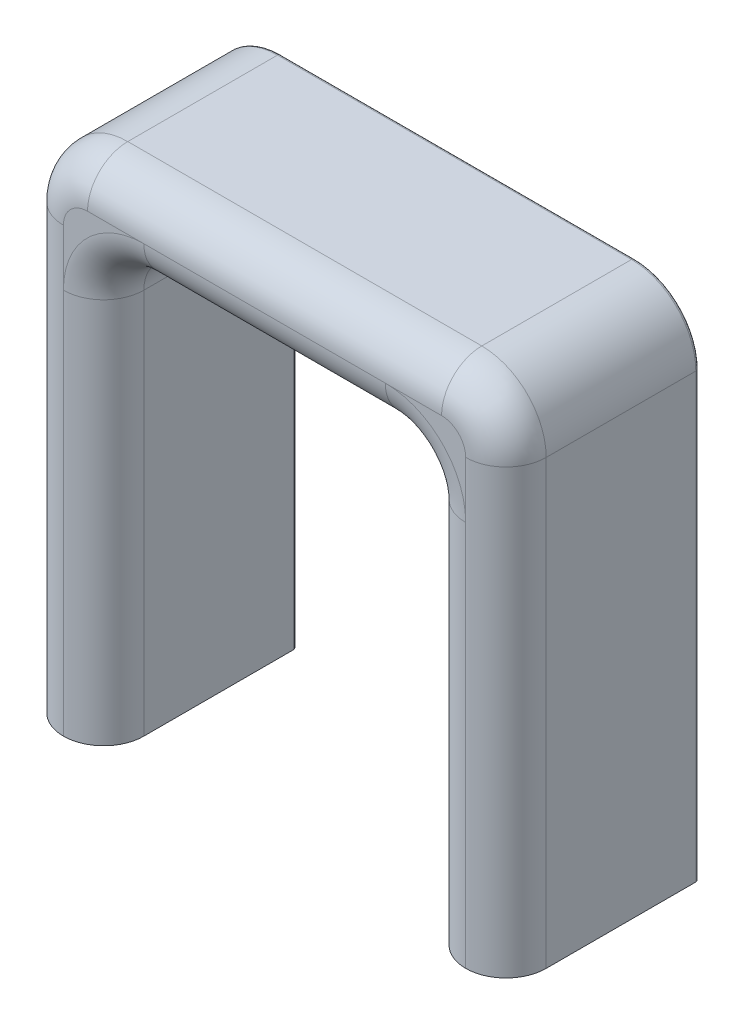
ISO-10303-21;
HEADER;
FILE_DESCRIPTION(('STEP AP214'),'2;1');
FILE_NAME('part.step','',(''),(''),'','','');
FILE_SCHEMA(('AUTOMOTIVE_DESIGN { 1 0 10303 214 1 1 1 1 }'));
ENDSEC;
DATA;
#1=APPLICATION_CONTEXT('core data for automotive mechanical design processes');
#2=APPLICATION_PROTOCOL_DEFINITION('international standard','automotive_design',2000,#1);
#3=PRODUCT_CONTEXT('',#1,'mechanical');
#4=PRODUCT('Part','Part','',(#3));
#5=PRODUCT_RELATED_PRODUCT_CATEGORY('part','',(#4));
#6=PRODUCT_DEFINITION_FORMATION('','',#4);
#7=PRODUCT_DEFINITION_CONTEXT('part definition',#1,'design');
#8=PRODUCT_DEFINITION('design','',#6,#7);
#9=PRODUCT_DEFINITION_SHAPE('','',#8);
#10=(LENGTH_UNIT() NAMED_UNIT(*) SI_UNIT(.MILLI.,.METRE.));
#11=(NAMED_UNIT(*) PLANE_ANGLE_UNIT() SI_UNIT($,.RADIAN.));
#12=(NAMED_UNIT(*) SI_UNIT($,.STERADIAN.) SOLID_ANGLE_UNIT());
#13=UNCERTAINTY_MEASURE_WITH_UNIT(LENGTH_MEASURE(1.E-05),#10,'distance_accuracy_value','');
#14=(GEOMETRIC_REPRESENTATION_CONTEXT(3) GLOBAL_UNCERTAINTY_ASSIGNED_CONTEXT((#13)) GLOBAL_UNIT_ASSIGNED_CONTEXT((#10,
#11,#12)) REPRESENTATION_CONTEXT('',''));
#15=CARTESIAN_POINT('',(0.,0.,0.));
#16=DIRECTION('',(0.,0.,1.));
#17=DIRECTION('',(1.,0.,0.));
#18=AXIS2_PLACEMENT_3D('',#15,#16,#17);
#19=CARTESIAN_POINT('',(-25.9999999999,27.4999999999,0.2));
#20=DIRECTION('',(0.,0.,1.));
#21=DIRECTION('',(0.,-1.,0.));
#22=AXIS2_PLACEMENT_3D('',#19,#20,#21);
#23=TOROIDAL_SURFACE('',#22,2.7,0.2);
#24=CARTESIAN_POINT('',(-26.000000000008,30.2,0.2));
#25=DIRECTION('',(-1.,-4.00027233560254E-11,0.));
#26=DIRECTION('',(4.00027233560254E-11,-1.,0.));
#27=AXIS2_PLACEMENT_3D('',#24,#25,#26);
#28=CIRCLE('',#27,0.2);
#29=CARTESIAN_POINT('',(-26.000000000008,30.2,0.));
#30=VERTEX_POINT('',#29);
#31=CARTESIAN_POINT('',(-26.,30.,0.2));
#32=VERTEX_POINT('',#31);
#33=EDGE_CURVE('E25',#30,#32,#28,.T.);
#34=ORIENTED_EDGE('',*,*,#33,.T.);
#35=CARTESIAN_POINT('',(-25.9999999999,27.4999999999,0.2));
#36=DIRECTION('',(0.,0.,-1.));
#37=DIRECTION('',(0.,-1.,0.));
#38=AXIS2_PLACEMENT_3D('',#35,#36,#37);
#39=CIRCLE('',#38,2.5);
#40=CARTESIAN_POINT('',(-28.4999999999,27.5,0.2));
#41=VERTEX_POINT('',#40);
#42=EDGE_CURVE('E457',#41,#32,#39,.T.);
#43=ORIENTED_EDGE('',*,*,#42,.F.);
#44=CARTESIAN_POINT('',(-28.7,27.5,0.2));
#45=DIRECTION('',(0.,1.,4.00027233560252E-11));
#46=DIRECTION('',(0.,-4.00027233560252E-11,1.));
#47=AXIS2_PLACEMENT_3D('',#44,#45,#46);
#48=CIRCLE('',#47,0.2);
#49=CARTESIAN_POINT('',(-28.7,27.500000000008,0.));
#50=VERTEX_POINT('',#49);
#51=EDGE_CURVE('E10',#41,#50,#48,.T.);
#52=ORIENTED_EDGE('',*,*,#51,.T.);
#53=CARTESIAN_POINT('',(-25.9999999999,27.4999999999,0.));
#54=DIRECTION('',(0.,0.,1.));
#55=DIRECTION('',(0.,-1.,0.));
#56=AXIS2_PLACEMENT_3D('',#53,#54,#55);
#57=CIRCLE('',#56,2.7);
#58=EDGE_CURVE('E1007',#30,#50,#57,.T.);
#59=ORIENTED_EDGE('',*,*,#58,.F.);
#60=EDGE_LOOP('',(#34,#43,#52,#59));
#61=FACE_BOUND('',#60,.T.);
#62=ADVANCED_FACE('F16',(#61),#23,.T.);
#63=CARTESIAN_POINT('',(-28.7,15.2730324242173,0.199999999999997));
#64=DIRECTION('',(0.,-1.,0.));
#65=DIRECTION('',(0.,0.,-1.));
#66=AXIS2_PLACEMENT_3D('',#63,#64,#65);
#67=CYLINDRICAL_SURFACE('',#66,0.2);
#68=CARTESIAN_POINT('',(-28.5,0.,0.199999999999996));
#69=CARTESIAN_POINT('',(-28.5,0.,0.0828427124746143));
#70=CARTESIAN_POINT('',(-28.5828427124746,0.0828427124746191,0.));
#71=CARTESIAN_POINT('',(-28.7,0.2,0.));
#72=(BOUNDED_CURVE() B_SPLINE_CURVE(3,(#68,#69,#70,#71),.UNSPECIFIED.,.F.,
.F.) B_SPLINE_CURVE_WITH_KNOTS((4,4),(0.,1.5707963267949),
.UNSPECIFIED.) CURVE() GEOMETRIC_REPRESENTATION_ITEM() RATIONAL_B_SPLINE_CURVE((1.,
0.804737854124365,0.804737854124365,1.)) REPRESENTATION_ITEM(''));
#73=CARTESIAN_POINT('',(-28.5,0.,0.199999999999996));
#74=VERTEX_POINT('',#73);
#75=CARTESIAN_POINT('',(-28.7,0.2,0.));
#76=VERTEX_POINT('',#75);
#77=EDGE_CURVE('E872',#74,#76,#72,.T.);
#78=ORIENTED_EDGE('',*,*,#77,.T.);
#79=DIRECTION('',(0.,-1.,0.));
#80=VECTOR('',#79,1.);
#81=CARTESIAN_POINT('',(-28.7,15.2730324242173,0.));
#82=LINE('',#81,#80);
#83=EDGE_CURVE('E423',#50,#76,#82,.T.);
#84=ORIENTED_EDGE('',*,*,#83,.F.);
#85=ORIENTED_EDGE('',*,*,#51,.F.);
#86=DIRECTION('',(0.,1.,0.));
#87=VECTOR('',#86,1.);
#88=CARTESIAN_POINT('',(-28.5,13.75,0.199999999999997));
#89=LINE('',#88,#87);
#90=EDGE_CURVE('E559',#74,#41,#89,.T.);
#91=ORIENTED_EDGE('',*,*,#90,.F.);
#92=EDGE_LOOP('',(#78,#84,#85,#91));
#93=FACE_BOUND('',#92,.T.);
#94=ADVANCED_FACE('F1118',(#93),#67,.T.);
#95=CARTESIAN_POINT('',(-15.,30.2,0.2));
#96=DIRECTION('',(-1.,0.,0.));
#97=DIRECTION('',(0.,0.,1.));
#98=AXIS2_PLACEMENT_3D('',#95,#96,#97);
#99=CYLINDRICAL_SURFACE('',#98,0.2);
#100=CARTESIAN_POINT('',(-4.,30.1999999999,0.2));
#101=DIRECTION('',(-1.,0.,0.));
#102=DIRECTION('',(0.,0.,1.));
#103=AXIS2_PLACEMENT_3D('',#100,#101,#102);
#104=CIRCLE('',#103,0.2);
#105=CARTESIAN_POINT('',(-4.,30.1999999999,0.));
#106=VERTEX_POINT('',#105);
#107=CARTESIAN_POINT('',(-4.,29.9999999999,0.2));
#108=VERTEX_POINT('',#107);
#109=EDGE_CURVE('E869',#106,#108,#104,.T.);
#110=ORIENTED_EDGE('',*,*,#109,.T.);
#111=DIRECTION('',(1.,0.,0.));
#112=VECTOR('',#111,1.);
#113=CARTESIAN_POINT('',(-15.,30.,0.2));
#114=LINE('',#113,#112);
#115=EDGE_CURVE('E602',#32,#108,#114,.T.);
#116=ORIENTED_EDGE('',*,*,#115,.F.);
#117=ORIENTED_EDGE('',*,*,#33,.F.);
#118=DIRECTION('',(-1.,0.,0.));
#119=VECTOR('',#118,1.);
#120=CARTESIAN_POINT('',(-15.,30.2,0.));
#121=LINE('',#120,#119);
#122=EDGE_CURVE('E1102',#106,#30,#121,.T.);
#123=ORIENTED_EDGE('',*,*,#122,.F.);
#124=EDGE_LOOP('',(#110,#116,#117,#123));
#125=FACE_BOUND('',#124,.T.);
#126=ADVANCED_FACE('F1016',(#125),#99,.T.);
#127=CARTESIAN_POINT('',(-15.,0.2,0.199999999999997));
#128=DIRECTION('',(-1.,0.,0.));
#129=DIRECTION('',(0.,0.,1.));
#130=AXIS2_PLACEMENT_3D('',#127,#128,#129);
#131=CYLINDRICAL_SURFACE('',#130,0.2);
#132=CARTESIAN_POINT('',(-30.,0.,0.199999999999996));
#133=CARTESIAN_POINT('',(-30.,0.,0.0828427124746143));
#134=CARTESIAN_POINT('',(-29.9171572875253,0.0828427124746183,0.));
#135=CARTESIAN_POINT('',(-29.8,0.2,0.));
#136=(BOUNDED_CURVE() B_SPLINE_CURVE(3,(#132,#133,#134,#135),.UNSPECIFIED.,.F.,
.F.) B_SPLINE_CURVE_WITH_KNOTS((4,4),(0.,1.5707963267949),
.UNSPECIFIED.) CURVE() GEOMETRIC_REPRESENTATION_ITEM() RATIONAL_B_SPLINE_CURVE((1.,
0.804737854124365,0.804737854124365,1.)) REPRESENTATION_ITEM(''));
#137=CARTESIAN_POINT('',(-30.,0.,0.199999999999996));
#138=VERTEX_POINT('',#137);
#139=CARTESIAN_POINT('',(-29.8,0.2,0.));
#140=VERTEX_POINT('',#139);
#141=EDGE_CURVE('E873',#138,#140,#136,.T.);
#142=ORIENTED_EDGE('',*,*,#141,.T.);
#143=DIRECTION('',(-1.,0.,0.));
#144=VECTOR('',#143,1.);
#145=CARTESIAN_POINT('',(-30.,0.2,0.));
#146=LINE('',#145,#144);
#147=EDGE_CURVE('E418',#76,#140,#146,.T.);
#148=ORIENTED_EDGE('',*,*,#147,.F.);
#149=ORIENTED_EDGE('',*,*,#77,.F.);
#150=DIRECTION('',(1.,0.,0.));
#151=VECTOR('',#150,1.);
#152=CARTESIAN_POINT('',(-28.5,0.,0.199999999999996));
#153=LINE('',#152,#151);
#154=EDGE_CURVE('E470',#138,#74,#153,.T.);
#155=ORIENTED_EDGE('',*,*,#154,.F.);
#156=EDGE_LOOP('',(#142,#148,#149,#155));
#157=FACE_BOUND('',#156,.T.);
#158=ADVANCED_FACE('F1286',(#157),#131,.T.);
#159=CARTESIAN_POINT('',(-4.00000000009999,27.4999999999,0.2));
#160=DIRECTION('',(0.,0.,1.));
#161=DIRECTION('',(0.,-1.,0.));
#162=AXIS2_PLACEMENT_3D('',#159,#160,#161);
#163=TOROIDAL_SURFACE('',#162,2.7,0.2);
#164=CARTESIAN_POINT('',(-1.3,27.500000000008,0.2));
#165=DIRECTION('',(-4.00027233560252E-11,1.,0.));
#166=DIRECTION('',(-1.,-4.00027233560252E-11,0.));
#167=AXIS2_PLACEMENT_3D('',#164,#165,#166);
#168=CIRCLE('',#167,0.2);
#169=CARTESIAN_POINT('',(-1.3,27.500000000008,0.));
#170=VERTEX_POINT('',#169);
#171=CARTESIAN_POINT('',(-1.5,27.5,0.2));
#172=VERTEX_POINT('',#171);
#173=EDGE_CURVE('E416',#170,#172,#168,.T.);
#174=ORIENTED_EDGE('',*,*,#173,.T.);
#175=CARTESIAN_POINT('',(-4.00000000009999,27.4999999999,0.2));
#176=DIRECTION('',(0.,0.,-1.));
#177=DIRECTION('',(0.,-1.,0.));
#178=AXIS2_PLACEMENT_3D('',#175,#176,#177);
#179=CIRCLE('',#178,2.5);
#180=EDGE_CURVE('E514',#108,#172,#179,.T.);
#181=ORIENTED_EDGE('',*,*,#180,.F.);
#182=ORIENTED_EDGE('',*,*,#109,.F.);
#183=CARTESIAN_POINT('',(-4.00000000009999,27.4999999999,0.));
#184=DIRECTION('',(0.,0.,1.));
#185=DIRECTION('',(0.,-1.,0.));
#186=AXIS2_PLACEMENT_3D('',#183,#184,#185);
#187=CIRCLE('',#186,2.7);
#188=EDGE_CURVE('E424',#170,#106,#187,.T.);
#189=ORIENTED_EDGE('',*,*,#188,.F.);
#190=EDGE_LOOP('',(#174,#181,#182,#189));
#191=FACE_BOUND('',#190,.T.);
#192=ADVANCED_FACE('F1200',(#191),#163,.T.);
#193=CARTESIAN_POINT('',(-29.8,13.75,0.199999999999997));
#194=DIRECTION('',(0.,1.,0.));
#195=DIRECTION('',(0.,0.,1.));
#196=AXIS2_PLACEMENT_3D('',#193,#194,#195);
#197=CYLINDRICAL_SURFACE('',#196,0.2);
#198=CARTESIAN_POINT('',(-29.7999999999,27.499999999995,0.2));
#199=DIRECTION('',(-2.49973652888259E-11,-1.,0.));
#200=DIRECTION('',(1.,-2.49973652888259E-11,0.));
#201=AXIS2_PLACEMENT_3D('',#198,#199,#200);
#202=CIRCLE('',#201,0.2);
#203=CARTESIAN_POINT('',(-29.9999999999,27.5,0.2));
#204=VERTEX_POINT('',#203);
#205=CARTESIAN_POINT('',(-29.8,27.499999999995,0.));
#206=VERTEX_POINT('',#205);
#207=EDGE_CURVE('E412',#204,#206,#202,.T.);
#208=ORIENTED_EDGE('',*,*,#207,.T.);
#209=DIRECTION('',(0.,1.,0.));
#210=VECTOR('',#209,1.);
#211=CARTESIAN_POINT('',(-29.8,27.5,0.));
#212=LINE('',#211,#210);
#213=EDGE_CURVE('E422',#140,#206,#212,.T.);
#214=ORIENTED_EDGE('',*,*,#213,.F.);
#215=ORIENTED_EDGE('',*,*,#141,.F.);
#216=DIRECTION('',(0.,-1.,0.));
#217=VECTOR('',#216,1.);
#218=CARTESIAN_POINT('',(-30.,0.,0.199999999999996));
#219=LINE('',#218,#217);
#220=EDGE_CURVE('E496',#204,#138,#219,.T.);
#221=ORIENTED_EDGE('',*,*,#220,.F.);
#222=EDGE_LOOP('',(#208,#214,#215,#221));
#223=FACE_BOUND('',#222,.T.);
#224=ADVANCED_FACE('F1283',(#223),#197,.T.);
#225=CARTESIAN_POINT('',(-1.3,15.2730324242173,0.2));
#226=DIRECTION('',(0.,1.,0.));
#227=DIRECTION('',(0.,0.,1.));
#228=AXIS2_PLACEMENT_3D('',#225,#226,#227);
#229=CYLINDRICAL_SURFACE('',#228,0.2);
#230=CARTESIAN_POINT('',(-1.3,0.2,0.));
#231=CARTESIAN_POINT('',(-1.41715728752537,0.0828427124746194,0.));
#232=CARTESIAN_POINT('',(-1.49999999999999,0.,0.0828427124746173));
#233=CARTESIAN_POINT('',(-1.5,0.,0.2));
#234=(BOUNDED_CURVE() B_SPLINE_CURVE(3,(#230,#231,#232,#233),.UNSPECIFIED.,.F.,
.F.) B_SPLINE_CURVE_WITH_KNOTS((4,4),(4.71238898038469,6.28318530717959),
.UNSPECIFIED.) CURVE() GEOMETRIC_REPRESENTATION_ITEM() RATIONAL_B_SPLINE_CURVE((1.,
0.804737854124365,0.804737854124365,1.)) REPRESENTATION_ITEM(''));
#235=CARTESIAN_POINT('',(-1.3,0.2,0.));
#236=VERTEX_POINT('',#235);
#237=CARTESIAN_POINT('',(-1.5,0.,0.2));
#238=VERTEX_POINT('',#237);
#239=EDGE_CURVE('E417',#236,#238,#234,.T.);
#240=ORIENTED_EDGE('',*,*,#239,.T.);
#241=DIRECTION('',(0.,-1.,0.));
#242=VECTOR('',#241,1.);
#243=CARTESIAN_POINT('',(-1.5,13.75,0.2));
#244=LINE('',#243,#242);
#245=EDGE_CURVE('E593',#172,#238,#244,.T.);
#246=ORIENTED_EDGE('',*,*,#245,.F.);
#247=ORIENTED_EDGE('',*,*,#173,.F.);
#248=DIRECTION('',(0.,1.,0.));
#249=VECTOR('',#248,1.);
#250=CARTESIAN_POINT('',(-1.3,15.2730324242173,0.));
#251=LINE('',#250,#249);
#252=EDGE_CURVE('E429',#236,#170,#251,.T.);
#253=ORIENTED_EDGE('',*,*,#252,.F.);
#254=EDGE_LOOP('',(#240,#246,#247,#253));
#255=FACE_BOUND('',#254,.T.);
#256=ADVANCED_FACE('F1408',(#255),#229,.T.);
#257=CARTESIAN_POINT('',(-25.9999999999,27.4999999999,0.2));
#258=DIRECTION('',(0.,0.,1.));
#259=DIRECTION('',(0.,-1.,0.));
#260=AXIS2_PLACEMENT_3D('',#257,#258,#259);
#261=TOROIDAL_SURFACE('',#260,3.8,0.2);
#262=CARTESIAN_POINT('',(-26.,31.3,0.2));
#263=DIRECTION('',(-1.,0.,0.));
#264=DIRECTION('',(0.,0.,1.));
#265=AXIS2_PLACEMENT_3D('',#262,#263,#264);
#266=CIRCLE('',#265,0.2);
#267=CARTESIAN_POINT('',(-26.,31.5,0.2));
#268=VERTEX_POINT('',#267);
#269=CARTESIAN_POINT('',(-26.,31.2999999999,0.));
#270=VERTEX_POINT('',#269);
#271=EDGE_CURVE('E966',#268,#270,#266,.T.);
#272=ORIENTED_EDGE('',*,*,#271,.T.);
#273=CARTESIAN_POINT('',(-25.9999999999,27.4999999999,0.));
#274=DIRECTION('',(0.,0.,-1.));
#275=DIRECTION('',(0.,-1.,0.));
#276=AXIS2_PLACEMENT_3D('',#273,#274,#275);
#277=CIRCLE('',#276,3.8);
#278=EDGE_CURVE('E410',#206,#270,#277,.T.);
#279=ORIENTED_EDGE('',*,*,#278,.F.);
#280=ORIENTED_EDGE('',*,*,#207,.F.);
#281=CARTESIAN_POINT('',(-25.9999999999,27.4999999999,0.2));
#282=DIRECTION('',(0.,0.,1.));
#283=DIRECTION('',(0.,-1.,0.));
#284=AXIS2_PLACEMENT_3D('',#281,#282,#283);
#285=CIRCLE('',#284,4.);
#286=EDGE_CURVE('E576',#268,#204,#285,.T.);
#287=ORIENTED_EDGE('',*,*,#286,.F.);
#288=EDGE_LOOP('',(#272,#279,#280,#287));
#289=FACE_BOUND('',#288,.T.);
#290=ADVANCED_FACE('F1166',(#289),#261,.T.);
#291=CARTESIAN_POINT('',(-15.,0.2,0.199999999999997));
#292=DIRECTION('',(-1.,0.,0.));
#293=DIRECTION('',(0.,0.,1.));
#294=AXIS2_PLACEMENT_3D('',#291,#292,#293);
#295=CYLINDRICAL_SURFACE('',#294,0.2);
#296=CARTESIAN_POINT('',(-0.199999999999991,0.2,0.));
#297=CARTESIAN_POINT('',(-0.0828427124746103,0.0828427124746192,0.));
#298=CARTESIAN_POINT('',(0.,0.,0.0828427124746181));
#299=CARTESIAN_POINT('',(0.,0.,0.2));
#300=(BOUNDED_CURVE() B_SPLINE_CURVE(3,(#296,#297,#298,#299),.UNSPECIFIED.,.F.,
.F.) B_SPLINE_CURVE_WITH_KNOTS((4,4),(4.71238898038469,6.28318530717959),
.UNSPECIFIED.) CURVE() GEOMETRIC_REPRESENTATION_ITEM() RATIONAL_B_SPLINE_CURVE((1.,
0.804737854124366,0.804737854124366,1.)) REPRESENTATION_ITEM(''));
#301=CARTESIAN_POINT('',(-0.199999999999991,0.2,0.));
#302=VERTEX_POINT('',#301);
#303=CARTESIAN_POINT('',(0.,0.,0.2));
#304=VERTEX_POINT('',#303);
#305=EDGE_CURVE('E961',#302,#304,#300,.T.);
#306=ORIENTED_EDGE('',*,*,#305,.T.);
#307=DIRECTION('',(1.,0.,0.));
#308=VECTOR('',#307,1.);
#309=CARTESIAN_POINT('',(0.,0.,0.2));
#310=LINE('',#309,#308);
#311=EDGE_CURVE('E523',#238,#304,#310,.T.);
#312=ORIENTED_EDGE('',*,*,#311,.F.);
#313=ORIENTED_EDGE('',*,*,#239,.F.);
#314=DIRECTION('',(-1.,0.,0.));
#315=VECTOR('',#314,1.);
#316=CARTESIAN_POINT('',(-1.5,0.2,0.));
#317=LINE('',#316,#315);
#318=EDGE_CURVE('E466',#302,#236,#317,.T.);
#319=ORIENTED_EDGE('',*,*,#318,.F.);
#320=EDGE_LOOP('',(#306,#312,#313,#319));
#321=FACE_BOUND('',#320,.T.);
#322=ADVANCED_FACE('F1407',(#321),#295,.T.);
#323=CARTESIAN_POINT('',(-15.,31.3,0.2));
#324=DIRECTION('',(1.,0.,0.));
#325=DIRECTION('',(0.,0.,-1.));
#326=AXIS2_PLACEMENT_3D('',#323,#324,#325);
#327=CYLINDRICAL_SURFACE('',#326,0.2);
#328=CARTESIAN_POINT('',(-4.00000000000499,31.2999999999,0.2));
#329=DIRECTION('',(-1.,2.49973652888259E-11,0.));
#330=DIRECTION('',(-2.49973652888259E-11,-1.,0.));
#331=AXIS2_PLACEMENT_3D('',#328,#329,#330);
#332=CIRCLE('',#331,0.2);
#333=CARTESIAN_POINT('',(-4.,31.4999999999,0.2));
#334=VERTEX_POINT('',#333);
#335=CARTESIAN_POINT('',(-4.00000000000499,31.3,0.));
#336=VERTEX_POINT('',#335);
#337=EDGE_CURVE('E951',#334,#336,#332,.T.);
#338=ORIENTED_EDGE('',*,*,#337,.T.);
#339=DIRECTION('',(1.,0.,0.));
#340=VECTOR('',#339,1.);
#341=CARTESIAN_POINT('',(-4.,31.3,0.));
#342=LINE('',#341,#340);
#343=EDGE_CURVE('E444',#270,#336,#342,.T.);
#344=ORIENTED_EDGE('',*,*,#343,.F.);
#345=ORIENTED_EDGE('',*,*,#271,.F.);
#346=DIRECTION('',(-1.,0.,0.));
#347=VECTOR('',#346,1.);
#348=CARTESIAN_POINT('',(-26.,31.5,0.2));
#349=LINE('',#348,#347);
#350=EDGE_CURVE('E462',#334,#268,#349,.T.);
#351=ORIENTED_EDGE('',*,*,#350,.F.);
#352=EDGE_LOOP('',(#338,#344,#345,#351));
#353=FACE_BOUND('',#352,.T.);
#354=ADVANCED_FACE('F1163',(#353),#327,.T.);
#355=CARTESIAN_POINT('',(-0.199999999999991,13.75,0.2));
#356=DIRECTION('',(0.,-1.,0.));
#357=DIRECTION('',(0.,0.,-1.));
#358=AXIS2_PLACEMENT_3D('',#355,#356,#357);
#359=CYLINDRICAL_SURFACE('',#358,0.2);
#360=CARTESIAN_POINT('',(-0.200000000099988,27.5,0.2));
#361=DIRECTION('',(0.,-1.,0.));
#362=DIRECTION('',(0.,0.,-1.));
#363=AXIS2_PLACEMENT_3D('',#360,#361,#362);
#364=CIRCLE('',#363,0.2);
#365=CARTESIAN_POINT('',(-0.200000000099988,27.5,0.));
#366=VERTEX_POINT('',#365);
#367=CARTESIAN_POINT('',(0.,27.5,0.2));
#368=VERTEX_POINT('',#367);
#369=EDGE_CURVE('E958',#366,#368,#364,.T.);
#370=ORIENTED_EDGE('',*,*,#369,.T.);
#371=DIRECTION('',(0.,1.,0.));
#372=VECTOR('',#371,1.);
#373=CARTESIAN_POINT('',(0.,27.5,0.2));
#374=LINE('',#373,#372);
#375=EDGE_CURVE('E555',#304,#368,#374,.T.);
#376=ORIENTED_EDGE('',*,*,#375,.F.);
#377=ORIENTED_EDGE('',*,*,#305,.F.);
#378=DIRECTION('',(0.,-1.,0.));
#379=VECTOR('',#378,1.);
#380=CARTESIAN_POINT('',(-0.199999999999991,0.,0.));
#381=LINE('',#380,#379);
#382=EDGE_CURVE('E452',#366,#302,#381,.T.);
#383=ORIENTED_EDGE('',*,*,#382,.F.);
#384=EDGE_LOOP('',(#370,#376,#377,#383));
#385=FACE_BOUND('',#384,.T.);
#386=ADVANCED_FACE('F1159',(#385),#359,.T.);
#387=CARTESIAN_POINT('',(-4.00000000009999,27.4999999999,0.2));
#388=DIRECTION('',(0.,0.,1.));
#389=DIRECTION('',(0.,-1.,0.));
#390=AXIS2_PLACEMENT_3D('',#387,#388,#389);
#391=TOROIDAL_SURFACE('',#390,3.8,0.2);
#392=ORIENTED_EDGE('',*,*,#337,.F.);
#393=CARTESIAN_POINT('',(-4.00000000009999,27.4999999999,0.2));
#394=DIRECTION('',(0.,0.,1.));
#395=DIRECTION('',(0.,-1.,0.));
#396=AXIS2_PLACEMENT_3D('',#393,#394,#395);
#397=CIRCLE('',#396,4.);
#398=EDGE_CURVE('E631',#368,#334,#397,.T.);
#399=ORIENTED_EDGE('',*,*,#398,.F.);
#400=ORIENTED_EDGE('',*,*,#369,.F.);
#401=CARTESIAN_POINT('',(-4.00000000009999,27.4999999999,0.));
#402=DIRECTION('',(0.,0.,-1.));
#403=DIRECTION('',(0.,-1.,0.));
#404=AXIS2_PLACEMENT_3D('',#401,#402,#403);
#405=CIRCLE('',#404,3.8);
#406=EDGE_CURVE('E448',#336,#366,#405,.T.);
#407=ORIENTED_EDGE('',*,*,#406,.F.);
#408=EDGE_LOOP('',(#392,#399,#400,#407));
#409=FACE_BOUND('',#408,.T.);
#410=ADVANCED_FACE('F1156',(#409),#391,.T.);
#411=CARTESIAN_POINT('',(-15.000000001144,0.2,0.199999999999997));
#412=DIRECTION('',(1.,0.,0.));
#413=DIRECTION('',(0.,0.,-1.));
#414=AXIS2_PLACEMENT_3D('',#411,#412,#413);
#415=CYLINDRICAL_SURFACE('',#414,0.2);
#416=CARTESIAN_POINT('',(-2.97857930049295,0.2,0.));
#417=CARTESIAN_POINT('',(-2.83855823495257,0.0828427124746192,0.));
#418=CARTESIAN_POINT('',(-2.73954838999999,0.,0.0828427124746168));
#419=CARTESIAN_POINT('',(-2.73954838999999,0.,0.2));
#420=(BOUNDED_CURVE() B_SPLINE_CURVE(3,(#416,#417,#418,#419),.UNSPECIFIED.,.F.,
.F.) B_SPLINE_CURVE_WITH_KNOTS((4,4),(1.5707963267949,3.1415926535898),
.UNSPECIFIED.) CURVE() GEOMETRIC_REPRESENTATION_ITEM() RATIONAL_B_SPLINE_CURVE((1.,
0.804737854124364,0.804737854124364,1.)) REPRESENTATION_ITEM(''));
#421=CARTESIAN_POINT('',(-2.97857930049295,0.2,0.));
#422=VERTEX_POINT('',#421);
#423=CARTESIAN_POINT('',(-2.73954838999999,0.,0.2));
#424=VERTEX_POINT('',#423);
#425=EDGE_CURVE('E372',#422,#424,#420,.T.);
#426=ORIENTED_EDGE('',*,*,#425,.T.);
#427=DIRECTION('',(1.,0.,0.));
#428=VECTOR('',#427,1.);
#429=CARTESIAN_POINT('',(-2.73954838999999,0.,0.2));
#430=LINE('',#429,#428);
#431=CARTESIAN_POINT('',(-5.,0.,0.2));
#432=VERTEX_POINT('',#431);
#433=EDGE_CURVE('E527',#432,#424,#430,.T.);
#434=ORIENTED_EDGE('',*,*,#433,.F.);
#435=CARTESIAN_POINT('',(-5.,0.,0.2));
#436=CARTESIAN_POINT('',(-4.99999999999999,0.,0.0828427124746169));
#437=CARTESIAN_POINT('',(-4.91715728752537,0.0828427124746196,0.));
#438=CARTESIAN_POINT('',(-4.8,0.2,0.));
#439=(BOUNDED_CURVE() B_SPLINE_CURVE(3,(#435,#436,#437,#438),.UNSPECIFIED.,.F.,
.F.) B_SPLINE_CURVE_WITH_KNOTS((4,4),(3.1415926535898,4.71238898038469),
.UNSPECIFIED.) CURVE() GEOMETRIC_REPRESENTATION_ITEM() RATIONAL_B_SPLINE_CURVE((1.,
0.804737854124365,0.804737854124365,1.)) REPRESENTATION_ITEM(''));
#440=CARTESIAN_POINT('',(-4.8,0.2,0.));
#441=VERTEX_POINT('',#440);
#442=EDGE_CURVE('E389',#432,#441,#439,.T.);
#443=ORIENTED_EDGE('',*,*,#442,.T.);
#444=DIRECTION('',(-1.,0.,0.));
#445=VECTOR('',#444,1.);
#446=CARTESIAN_POINT('',(-5.,0.2,0.));
#447=LINE('',#446,#445);
#448=EDGE_CURVE('E719',#422,#441,#447,.T.);
#449=ORIENTED_EDGE('',*,*,#448,.F.);
#450=EDGE_LOOP('',(#426,#434,#443,#449));
#451=FACE_BOUND('',#450,.T.);
#452=ADVANCED_FACE('F1253',(#451),#415,.T.);
#453=CARTESIAN_POINT('',(-4.8,13.6915858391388,0.2));
#454=DIRECTION('',(0.,1.,0.));
#455=DIRECTION('',(0.,0.,1.));
#456=AXIS2_PLACEMENT_3D('',#453,#454,#455);
#457=CYLINDRICAL_SURFACE('',#456,0.2);
#458=CARTESIAN_POINT('',(-4.80000000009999,24.000000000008,0.2));
#459=DIRECTION('',(4.00027233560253E-11,-1.,0.));
#460=DIRECTION('',(1.,4.00027233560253E-11,0.));
#461=AXIS2_PLACEMENT_3D('',#458,#459,#460);
#462=CIRCLE('',#461,0.2);
#463=CARTESIAN_POINT('',(-5.,24.,0.2));
#464=VERTEX_POINT('',#463);
#465=CARTESIAN_POINT('',(-4.8,24.000000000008,0.));
#466=VERTEX_POINT('',#465);
#467=EDGE_CURVE('E360',#464,#466,#462,.T.);
#468=ORIENTED_EDGE('',*,*,#467,.T.);
#469=DIRECTION('',(0.,1.,0.));
#470=VECTOR('',#469,1.);
#471=CARTESIAN_POINT('',(-4.8,13.6915858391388,0.));
#472=LINE('',#471,#470);
#473=EDGE_CURVE('E642',#441,#466,#472,.T.);
#474=ORIENTED_EDGE('',*,*,#473,.F.);
#475=ORIENTED_EDGE('',*,*,#442,.F.);
#476=DIRECTION('',(0.,-1.,0.));
#477=VECTOR('',#476,1.);
#478=CARTESIAN_POINT('',(-5.,12.,0.2));
#479=LINE('',#478,#477);
#480=EDGE_CURVE('E387',#464,#432,#479,.T.);
#481=ORIENTED_EDGE('',*,*,#480,.F.);
#482=EDGE_LOOP('',(#468,#474,#475,#481));
#483=FACE_BOUND('',#482,.T.);
#484=ADVANCED_FACE('F388',(#483),#457,.T.);
#485=CARTESIAN_POINT('',(-5.695425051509,15.3591642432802,0.2));
#486=DIRECTION('',(-0.176410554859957,0.984316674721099,0.));
#487=DIRECTION('',(-0.984316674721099,-0.176410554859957,0.));
#488=AXIS2_PLACEMENT_3D('',#485,#486,#487);
#489=CYLINDRICAL_SURFACE('',#488,0.2);
#490=CARTESIAN_POINT('',(-3.65750689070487,3.98820727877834,0.));
#491=CARTESIAN_POINT('',(-3.53595216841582,3.97408651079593,0.));
#492=CARTESIAN_POINT('',(-3.44999999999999,3.96410162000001,0.0828427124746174));
#493=CARTESIAN_POINT('',(-3.45,3.96410162,0.2));
#494=(BOUNDED_CURVE() B_SPLINE_CURVE(3,(#490,#491,#492,#493),.UNSPECIFIED.,.F.,
.F.) B_SPLINE_CURVE_WITH_KNOTS((4,4),(1.5707963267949,3.1415926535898),
.UNSPECIFIED.) CURVE() GEOMETRIC_REPRESENTATION_ITEM() RATIONAL_B_SPLINE_CURVE((1.,
0.804737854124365,0.804737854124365,1.)) REPRESENTATION_ITEM(''));
#495=CARTESIAN_POINT('',(-3.65750689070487,3.98820727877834,0.));
#496=VERTEX_POINT('',#495);
#497=CARTESIAN_POINT('',(-3.45,3.96410162,0.2));
#498=VERTEX_POINT('',#497);
#499=EDGE_CURVE('E373',#496,#498,#494,.T.);
#500=ORIENTED_EDGE('',*,*,#499,.T.);
#501=DIRECTION('',(-0.176410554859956,0.984316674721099,0.));
#502=VECTOR('',#501,1.);
#503=CARTESIAN_POINT('',(-3.45,3.96410162,0.2));
#504=LINE('',#503,#502);
#505=EDGE_CURVE('E617',#424,#498,#504,.T.);
#506=ORIENTED_EDGE('',*,*,#505,.F.);
#507=ORIENTED_EDGE('',*,*,#425,.F.);
#508=DIRECTION('',(0.176410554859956,-0.984316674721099,0.));
#509=VECTOR('',#508,1.);
#510=CARTESIAN_POINT('',(-2.93641172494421,-0.0352821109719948,0.));
#511=LINE('',#510,#509);
#512=EDGE_CURVE('E586',#496,#422,#511,.T.);
#513=ORIENTED_EDGE('',*,*,#512,.F.);
#514=EDGE_LOOP('',(#500,#506,#507,#513));
#515=FACE_BOUND('',#514,.T.);
#516=ADVANCED_FACE('F1250',(#515),#489,.T.);
#517=CARTESIAN_POINT('',(-7.50000000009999,23.9999999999,0.2));
#518=DIRECTION('',(0.,0.,1.));
#519=DIRECTION('',(0.,-1.,0.));
#520=AXIS2_PLACEMENT_3D('',#517,#518,#519);
#521=TOROIDAL_SURFACE('',#520,2.7,0.2);
#522=CARTESIAN_POINT('',(-7.5,26.7,0.2));
#523=DIRECTION('',(1.,0.,0.));
#524=DIRECTION('',(0.,0.,-1.));
#525=AXIS2_PLACEMENT_3D('',#522,#523,#524);
#526=CIRCLE('',#525,0.2);
#527=CARTESIAN_POINT('',(-7.5,26.4999999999,0.2));
#528=VERTEX_POINT('',#527);
#529=CARTESIAN_POINT('',(-7.5,26.6999999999,0.));
#530=VERTEX_POINT('',#529);
#531=EDGE_CURVE('E934',#528,#530,#526,.T.);
#532=ORIENTED_EDGE('',*,*,#531,.T.);
#533=CARTESIAN_POINT('',(-7.50000000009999,23.9999999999,0.));
#534=DIRECTION('',(0.,0.,1.));
#535=DIRECTION('',(0.,-1.,0.));
#536=AXIS2_PLACEMENT_3D('',#533,#534,#535);
#537=CIRCLE('',#536,2.7);
#538=EDGE_CURVE('E366',#466,#530,#537,.T.);
#539=ORIENTED_EDGE('',*,*,#538,.F.);
#540=ORIENTED_EDGE('',*,*,#467,.F.);
#541=CARTESIAN_POINT('',(-7.50000000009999,23.9999999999,0.2));
#542=DIRECTION('',(0.,0.,-1.));
#543=DIRECTION('',(0.,-1.,0.));
#544=AXIS2_PLACEMENT_3D('',#541,#542,#543);
#545=CIRCLE('',#544,2.5);
#546=EDGE_CURVE('E363',#528,#464,#545,.T.);
#547=ORIENTED_EDGE('',*,*,#546,.F.);
#548=EDGE_LOOP('',(#532,#539,#540,#547));
#549=FACE_BOUND('',#548,.T.);
#550=ADVANCED_FACE('F362',(#549),#521,.T.);
#551=CARTESIAN_POINT('',(-1.9101648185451,8.02352094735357,0.2));
#552=DIRECTION('',(0.397359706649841,0.917662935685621,0.));
#553=DIRECTION('',(-0.917662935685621,0.397359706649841,0.));
#554=AXIS2_PLACEMENT_3D('',#551,#552,#553);
#555=CYLINDRICAL_SURFACE('',#554,0.2);
#556=CARTESIAN_POINT('',(-3.4,4.58289397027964,0.));
#557=CARTESIAN_POINT('',(-3.28284271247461,4.55861776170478,0.));
#558=CARTESIAN_POINT('',(-3.19999999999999,4.54145189,0.0828427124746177));
#559=CARTESIAN_POINT('',(-3.2,4.54145189,0.2));
#560=(BOUNDED_CURVE() B_SPLINE_CURVE(3,(#556,#557,#558,#559),.UNSPECIFIED.,.F.,
.F.) B_SPLINE_CURVE_WITH_KNOTS((4,4),(1.5707963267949,3.1415926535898),
.UNSPECIFIED.) CURVE() GEOMETRIC_REPRESENTATION_ITEM() RATIONAL_B_SPLINE_CURVE((1.,
0.804737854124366,0.804737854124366,1.)) REPRESENTATION_ITEM(''));
#561=CARTESIAN_POINT('',(-3.4,4.58289397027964,0.));
#562=VERTEX_POINT('',#561);
#563=CARTESIAN_POINT('',(-3.2,4.54145189,0.2));
#564=VERTEX_POINT('',#563);
#565=EDGE_CURVE('E929',#562,#564,#560,.T.);
#566=ORIENTED_EDGE('',*,*,#565,.T.);
#567=DIRECTION('',(0.397359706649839,0.917662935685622,0.));
#568=VECTOR('',#567,1.);
#569=CARTESIAN_POINT('',(-3.2,4.54145189,0.2));
#570=LINE('',#569,#568);
#571=EDGE_CURVE('E776',#498,#564,#570,.T.);
#572=ORIENTED_EDGE('',*,*,#571,.F.);
#573=ORIENTED_EDGE('',*,*,#499,.F.);
#574=DIRECTION('',(-0.397359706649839,-0.917662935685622,0.));
#575=VECTOR('',#574,1.);
#576=CARTESIAN_POINT('',(-3.63353258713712,4.04357356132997,0.));
#577=LINE('',#576,#575);
#578=EDGE_CURVE('E430',#562,#496,#577,.T.);
#579=ORIENTED_EDGE('',*,*,#578,.F.);
#580=EDGE_LOOP('',(#566,#572,#573,#579));
#581=FACE_BOUND('',#580,.T.);
#582=ADVANCED_FACE('F1247',(#581),#555,.T.);
#583=CARTESIAN_POINT('',(-15.000000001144,26.7,0.2));
#584=DIRECTION('',(-1.,0.,0.));
#585=DIRECTION('',(0.,0.,1.));
#586=AXIS2_PLACEMENT_3D('',#583,#584,#585);
#587=CYLINDRICAL_SURFACE('',#586,0.2);
#588=CARTESIAN_POINT('',(-22.500000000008,26.6999999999,0.2));
#589=DIRECTION('',(1.,4.00027233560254E-11,0.));
#590=DIRECTION('',(-4.00027233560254E-11,1.,0.));
#591=AXIS2_PLACEMENT_3D('',#588,#589,#590);
#592=CIRCLE('',#591,0.2);
#593=CARTESIAN_POINT('',(-22.5,26.5,0.2));
#594=VERTEX_POINT('',#593);
#595=CARTESIAN_POINT('',(-22.500000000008,26.7,0.));
#596=VERTEX_POINT('',#595);
#597=EDGE_CURVE('E925',#594,#596,#592,.T.);
#598=ORIENTED_EDGE('',*,*,#597,.T.);
#599=DIRECTION('',(-1.,0.,0.));
#600=VECTOR('',#599,1.);
#601=CARTESIAN_POINT('',(-15.000000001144,26.7,0.));
#602=LINE('',#601,#600);
#603=EDGE_CURVE('E547',#530,#596,#602,.T.);
#604=ORIENTED_EDGE('',*,*,#603,.F.);
#605=ORIENTED_EDGE('',*,*,#531,.F.);
#606=DIRECTION('',(1.,0.,0.));
#607=VECTOR('',#606,1.);
#608=CARTESIAN_POINT('',(-15.,26.5,0.2));
#609=LINE('',#608,#607);
#610=EDGE_CURVE('E797',#594,#528,#609,.T.);
#611=ORIENTED_EDGE('',*,*,#610,.F.);
#612=EDGE_LOOP('',(#598,#604,#605,#611));
#613=FACE_BOUND('',#612,.T.);
#614=ADVANCED_FACE('F1257',(#613),#587,.T.);
#615=CARTESIAN_POINT('',(-3.4,13.6915858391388,0.2));
#616=DIRECTION('',(0.,1.,0.));
#617=DIRECTION('',(0.,0.,1.));
#618=AXIS2_PLACEMENT_3D('',#615,#616,#617);
#619=CYLINDRICAL_SURFACE('',#618,0.2);
#620=CARTESIAN_POINT('',(-3.4,24.50000001,0.2));
#621=DIRECTION('',(0.,-1.,0.));
#622=DIRECTION('',(0.,0.,-1.));
#623=AXIS2_PLACEMENT_3D('',#620,#621,#622);
#624=CIRCLE('',#623,0.2);
#625=CARTESIAN_POINT('',(-3.4,24.50000001,0.));
#626=VERTEX_POINT('',#625);
#627=CARTESIAN_POINT('',(-3.2,24.50000001,0.2));
#628=VERTEX_POINT('',#627);
#629=EDGE_CURVE('E922',#626,#628,#624,.T.);
#630=ORIENTED_EDGE('',*,*,#629,.T.);
#631=DIRECTION('',(0.,1.,0.));
#632=VECTOR('',#631,1.);
#633=CARTESIAN_POINT('',(-3.2,24.50000001,0.2));
#634=LINE('',#633,#632);
#635=EDGE_CURVE('E440',#564,#628,#634,.T.);
#636=ORIENTED_EDGE('',*,*,#635,.F.);
#637=ORIENTED_EDGE('',*,*,#565,.F.);
#638=DIRECTION('',(0.,-1.,0.));
#639=VECTOR('',#638,1.);
#640=CARTESIAN_POINT('',(-3.4,4.54145189,0.));
#641=LINE('',#640,#639);
#642=EDGE_CURVE('E435',#626,#562,#641,.T.);
#643=ORIENTED_EDGE('',*,*,#642,.F.);
#644=EDGE_LOOP('',(#630,#636,#637,#643));
#645=FACE_BOUND('',#644,.T.);
#646=ADVANCED_FACE('F1243',(#645),#619,.T.);
#647=CARTESIAN_POINT('',(-22.4999999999,23.9999999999,0.2));
#648=DIRECTION('',(0.,0.,1.));
#649=DIRECTION('',(0.,-1.,0.));
#650=AXIS2_PLACEMENT_3D('',#647,#648,#649);
#651=TOROIDAL_SURFACE('',#650,2.7,0.2);
#652=CARTESIAN_POINT('',(-25.2,24.,0.2));
#653=DIRECTION('',(0.,1.,0.));
#654=DIRECTION('',(0.,0.,1.));
#655=AXIS2_PLACEMENT_3D('',#652,#653,#654);
#656=CIRCLE('',#655,0.2);
#657=CARTESIAN_POINT('',(-24.9999999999,24.,0.2));
#658=VERTEX_POINT('',#657);
#659=CARTESIAN_POINT('',(-25.1999999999,24.,0.));
#660=VERTEX_POINT('',#659);
#661=EDGE_CURVE('E919',#658,#660,#656,.T.);
#662=ORIENTED_EDGE('',*,*,#661,.T.);
#663=CARTESIAN_POINT('',(-22.4999999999,23.9999999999,0.));
#664=DIRECTION('',(0.,0.,1.));
#665=DIRECTION('',(0.,-1.,0.));
#666=AXIS2_PLACEMENT_3D('',#663,#664,#665);
#667=CIRCLE('',#666,2.7);
#668=EDGE_CURVE('E551',#596,#660,#667,.T.);
#669=ORIENTED_EDGE('',*,*,#668,.F.);
#670=ORIENTED_EDGE('',*,*,#597,.F.);
#671=CARTESIAN_POINT('',(-22.4999999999,23.9999999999,0.2));
#672=DIRECTION('',(0.,0.,-1.));
#673=DIRECTION('',(0.,-1.,0.));
#674=AXIS2_PLACEMENT_3D('',#671,#672,#673);
#675=CIRCLE('',#674,2.5);
#676=EDGE_CURVE('E865',#658,#594,#675,.T.);
#677=ORIENTED_EDGE('',*,*,#676,.F.);
#678=EDGE_LOOP('',(#662,#669,#670,#677));
#679=FACE_BOUND('',#678,.T.);
#680=ADVANCED_FACE('F1262',(#679),#651,.T.);
#681=CARTESIAN_POINT('',(-7.49999999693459,24.5000000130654,0.2));
#682=DIRECTION('',(0.,0.,1.));
#683=DIRECTION('',(0.,-1.,0.));
#684=AXIS2_PLACEMENT_3D('',#681,#682,#683);
#685=TOROIDAL_SURFACE('',#684,4.09999999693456,0.2);
#686=CARTESIAN_POINT('',(-7.49999999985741,28.60000001,0.2));
#687=DIRECTION('',(1.,7.12884612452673E-10,0.));
#688=DIRECTION('',(-7.12884612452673E-10,1.,0.));
#689=AXIS2_PLACEMENT_3D('',#686,#687,#688);
#690=CIRCLE('',#689,0.2);
#691=CARTESIAN_POINT('',(-7.49999999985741,28.60000001,0.));
#692=VERTEX_POINT('',#691);
#693=CARTESIAN_POINT('',(-7.5,28.80000001,0.2));
#694=VERTEX_POINT('',#693);
#695=EDGE_CURVE('E913',#692,#694,#690,.T.);
#696=ORIENTED_EDGE('',*,*,#695,.T.);
#697=CARTESIAN_POINT('',(-7.49999999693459,24.5000000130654,0.2));
#698=DIRECTION('',(0.,0.,1.));
#699=DIRECTION('',(0.,-1.,0.));
#700=AXIS2_PLACEMENT_3D('',#697,#698,#699);
#701=CIRCLE('',#700,4.29999999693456);
#702=EDGE_CURVE('E439',#628,#694,#701,.T.);
#703=ORIENTED_EDGE('',*,*,#702,.F.);
#704=ORIENTED_EDGE('',*,*,#629,.F.);
#705=CARTESIAN_POINT('',(-7.49999999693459,24.5000000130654,0.));
#706=DIRECTION('',(0.,0.,-1.));
#707=DIRECTION('',(0.,-1.,0.));
#708=AXIS2_PLACEMENT_3D('',#705,#706,#707);
#709=CIRCLE('',#708,4.09999999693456);
#710=EDGE_CURVE('E830',#692,#626,#709,.T.);
#711=ORIENTED_EDGE('',*,*,#710,.F.);
#712=EDGE_LOOP('',(#696,#703,#704,#711));
#713=FACE_BOUND('',#712,.T.);
#714=ADVANCED_FACE('F1241',(#713),#685,.T.);
#715=CARTESIAN_POINT('',(-25.2,13.6915858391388,0.199999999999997));
#716=DIRECTION('',(0.,-1.,0.));
#717=DIRECTION('',(0.,0.,-1.));
#718=AXIS2_PLACEMENT_3D('',#715,#716,#717);
#719=CYLINDRICAL_SURFACE('',#718,0.2);
#720=CARTESIAN_POINT('',(-25.,0.,0.199999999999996));
#721=CARTESIAN_POINT('',(-25.,0.,0.0828427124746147));
#722=CARTESIAN_POINT('',(-25.0828427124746,0.0828427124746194,0.));
#723=CARTESIAN_POINT('',(-25.2,0.2,0.));
#724=(BOUNDED_CURVE() B_SPLINE_CURVE(3,(#720,#721,#722,#723),.UNSPECIFIED.,.F.,
.F.) B_SPLINE_CURVE_WITH_KNOTS((4,4),(0.,1.5707963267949),
.UNSPECIFIED.) CURVE() GEOMETRIC_REPRESENTATION_ITEM() RATIONAL_B_SPLINE_CURVE((1.,
0.804737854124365,0.804737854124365,1.)) REPRESENTATION_ITEM(''));
#725=CARTESIAN_POINT('',(-25.,0.,0.199999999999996));
#726=VERTEX_POINT('',#725);
#727=CARTESIAN_POINT('',(-25.2,0.2,0.));
#728=VERTEX_POINT('',#727);
#729=EDGE_CURVE('E908',#726,#728,#724,.T.);
#730=ORIENTED_EDGE('',*,*,#729,.T.);
#731=DIRECTION('',(0.,-1.,0.));
#732=VECTOR('',#731,1.);
#733=CARTESIAN_POINT('',(-25.2,13.6915858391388,0.));
#734=LINE('',#733,#732);
#735=EDGE_CURVE('E610',#660,#728,#734,.T.);
#736=ORIENTED_EDGE('',*,*,#735,.F.);
#737=ORIENTED_EDGE('',*,*,#661,.F.);
#738=DIRECTION('',(0.,1.,0.));
#739=VECTOR('',#738,1.);
#740=CARTESIAN_POINT('',(-25.,12.,0.199999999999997));
#741=LINE('',#740,#739);
#742=EDGE_CURVE('E723',#726,#658,#741,.T.);
#743=ORIENTED_EDGE('',*,*,#742,.F.);
#744=EDGE_LOOP('',(#730,#736,#737,#743));
#745=FACE_BOUND('',#744,.T.);
#746=ADVANCED_FACE('F1264',(#745),#719,.T.);
#747=CARTESIAN_POINT('',(-15.000000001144,28.60000001,0.2));
#748=DIRECTION('',(-1.,0.,0.));
#749=DIRECTION('',(0.,0.,1.));
#750=AXIS2_PLACEMENT_3D('',#747,#748,#749);
#751=CYLINDRICAL_SURFACE('',#750,0.2);
#752=CARTESIAN_POINT('',(-22.5,28.6000000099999,0.2));
#753=DIRECTION('',(1.,0.,0.));
#754=DIRECTION('',(0.,0.,-1.));
#755=AXIS2_PLACEMENT_3D('',#752,#753,#754);
#756=CIRCLE('',#755,0.2);
#757=CARTESIAN_POINT('',(-22.5,28.6000000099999,0.));
#758=VERTEX_POINT('',#757);
#759=CARTESIAN_POINT('',(-22.5,28.80000001,0.2));
#760=VERTEX_POINT('',#759);
#761=EDGE_CURVE('E902',#758,#760,#756,.T.);
#762=ORIENTED_EDGE('',*,*,#761,.T.);
#763=DIRECTION('',(-1.,0.,0.));
#764=VECTOR('',#763,1.);
#765=CARTESIAN_POINT('',(-22.5,28.80000001,0.2));
#766=LINE('',#765,#764);
#767=EDGE_CURVE('E800',#694,#760,#766,.T.);
#768=ORIENTED_EDGE('',*,*,#767,.F.);
#769=ORIENTED_EDGE('',*,*,#695,.F.);
#770=DIRECTION('',(1.,0.,0.));
#771=VECTOR('',#770,1.);
#772=CARTESIAN_POINT('',(-7.5,28.60000001,0.));
#773=LINE('',#772,#771);
#774=EDGE_CURVE('E639',#758,#692,#773,.T.);
#775=ORIENTED_EDGE('',*,*,#774,.F.);
#776=EDGE_LOOP('',(#762,#768,#769,#775));
#777=FACE_BOUND('',#776,.T.);
#778=ADVANCED_FACE('F1237',(#777),#751,.T.);
#779=CARTESIAN_POINT('',(-15.000000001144,0.2,0.199999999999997));
#780=DIRECTION('',(1.,0.,0.));
#781=DIRECTION('',(0.,0.,-1.));
#782=AXIS2_PLACEMENT_3D('',#779,#780,#781);
#783=CYLINDRICAL_SURFACE('',#782,0.2);
#784=CARTESIAN_POINT('',(-27.26045162,0.,0.199999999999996));
#785=CARTESIAN_POINT('',(-27.26045162,0.,0.082842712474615));
#786=CARTESIAN_POINT('',(-27.1614417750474,0.0828427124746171,0.));
#787=CARTESIAN_POINT('',(-27.0214207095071,0.2,0.));
#788=(BOUNDED_CURVE() B_SPLINE_CURVE(3,(#784,#785,#786,#787),.UNSPECIFIED.,.F.,
.F.) B_SPLINE_CURVE_WITH_KNOTS((4,4),(3.1415926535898,4.71238898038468),
.UNSPECIFIED.) CURVE() GEOMETRIC_REPRESENTATION_ITEM() RATIONAL_B_SPLINE_CURVE((1.,
0.804737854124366,0.804737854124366,1.)) REPRESENTATION_ITEM(''));
#789=CARTESIAN_POINT('',(-27.26045162,0.,0.199999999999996));
#790=VERTEX_POINT('',#789);
#791=CARTESIAN_POINT('',(-27.0214207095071,0.2,0.));
#792=VERTEX_POINT('',#791);
#793=EDGE_CURVE('E897',#790,#792,#788,.T.);
#794=ORIENTED_EDGE('',*,*,#793,.T.);
#795=DIRECTION('',(-1.,0.,0.));
#796=VECTOR('',#795,1.);
#797=CARTESIAN_POINT('',(-27.26045162,0.2,0.));
#798=LINE('',#797,#796);
#799=EDGE_CURVE('E614',#728,#792,#798,.T.);
#800=ORIENTED_EDGE('',*,*,#799,.F.);
#801=ORIENTED_EDGE('',*,*,#729,.F.);
#802=DIRECTION('',(1.,0.,0.));
#803=VECTOR('',#802,1.);
#804=CARTESIAN_POINT('',(-25.,0.,0.199999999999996));
#805=LINE('',#804,#803);
#806=EDGE_CURVE('E434',#790,#726,#805,.T.);
#807=ORIENTED_EDGE('',*,*,#806,.F.);
#808=EDGE_LOOP('',(#794,#800,#801,#807));
#809=FACE_BOUND('',#808,.T.);
#810=ADVANCED_FACE('F1219',(#809),#783,.T.);
#811=CARTESIAN_POINT('',(-22.5000000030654,24.5000000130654,0.2));
#812=DIRECTION('',(0.,0.,1.));
#813=DIRECTION('',(0.,-1.,0.));
#814=AXIS2_PLACEMENT_3D('',#811,#812,#813);
#815=TOROIDAL_SURFACE('',#814,4.09999999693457,0.2);
#816=CARTESIAN_POINT('',(-26.6,24.5000000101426,0.2));
#817=DIRECTION('',(-7.12884612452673E-10,1.,0.));
#818=DIRECTION('',(-1.,-7.12884612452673E-10,0.));
#819=AXIS2_PLACEMENT_3D('',#816,#817,#818);
#820=CIRCLE('',#819,0.2);
#821=CARTESIAN_POINT('',(-26.6,24.5000000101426,0.));
#822=VERTEX_POINT('',#821);
#823=CARTESIAN_POINT('',(-26.8,24.50000001,0.2));
#824=VERTEX_POINT('',#823);
#825=EDGE_CURVE('E891',#822,#824,#820,.T.);
#826=ORIENTED_EDGE('',*,*,#825,.T.);
#827=CARTESIAN_POINT('',(-22.5000000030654,24.5000000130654,0.2));
#828=DIRECTION('',(0.,0.,1.));
#829=DIRECTION('',(0.,-1.,0.));
#830=AXIS2_PLACEMENT_3D('',#827,#828,#829);
#831=CIRCLE('',#830,4.29999999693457);
#832=EDGE_CURVE('E807',#760,#824,#831,.T.);
#833=ORIENTED_EDGE('',*,*,#832,.F.);
#834=ORIENTED_EDGE('',*,*,#761,.F.);
#835=CARTESIAN_POINT('',(-22.5000000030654,24.5000000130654,0.));
#836=DIRECTION('',(0.,0.,-1.));
#837=DIRECTION('',(0.,-1.,0.));
#838=AXIS2_PLACEMENT_3D('',#835,#836,#837);
#839=CIRCLE('',#838,4.09999999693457);
#840=EDGE_CURVE('E635',#822,#758,#839,.T.);
#841=ORIENTED_EDGE('',*,*,#840,.F.);
#842=EDGE_LOOP('',(#826,#833,#834,#841));
#843=FACE_BOUND('',#842,.T.);
#844=ADVANCED_FACE('F1233',(#843),#815,.T.);
#845=CARTESIAN_POINT('',(-24.3045749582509,15.3591642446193,0.199999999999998));
#846=DIRECTION('',(-0.176410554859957,-0.984316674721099,0.));
#847=DIRECTION('',(0.984316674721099,-0.176410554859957,0.));
#848=AXIS2_PLACEMENT_3D('',#845,#846,#847);
#849=CYLINDRICAL_SURFACE('',#848,0.2);
#850=CARTESIAN_POINT('',(-26.55000001,3.96410162,0.199999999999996));
#851=CARTESIAN_POINT('',(-26.5500000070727,3.96410163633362,0.0828427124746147));
#852=CARTESIAN_POINT('',(-26.4640478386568,3.97408652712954,0.));
#853=CARTESIAN_POINT('',(-26.3424931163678,3.98820729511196,0.));
#854=(BOUNDED_CURVE() B_SPLINE_CURVE(3,(#850,#851,#852,#853),.UNSPECIFIED.,.F.,
.F.) B_SPLINE_CURVE_WITH_KNOTS((4,4),(3.1415926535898,4.71238898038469),
.UNSPECIFIED.) CURVE() GEOMETRIC_REPRESENTATION_ITEM() RATIONAL_B_SPLINE_CURVE((1.,
0.804737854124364,0.804737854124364,1.)) REPRESENTATION_ITEM(''));
#855=CARTESIAN_POINT('',(-26.55000001,3.96410162,0.199999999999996));
#856=VERTEX_POINT('',#855);
#857=CARTESIAN_POINT('',(-26.3424931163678,3.98820729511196,0.));
#858=VERTEX_POINT('',#857);
#859=EDGE_CURVE('E878',#856,#858,#854,.T.);
#860=ORIENTED_EDGE('',*,*,#859,.T.);
#861=DIRECTION('',(0.176410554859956,0.984316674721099,0.));
#862=VECTOR('',#861,1.);
#863=CARTESIAN_POINT('',(-26.3531366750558,3.92881950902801,0.));
#864=LINE('',#863,#862);
#865=EDGE_CURVE('E569',#792,#858,#864,.T.);
#866=ORIENTED_EDGE('',*,*,#865,.F.);
#867=ORIENTED_EDGE('',*,*,#793,.F.);
#868=DIRECTION('',(-0.176410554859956,-0.984316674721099,0.));
#869=VECTOR('',#868,1.);
#870=CARTESIAN_POINT('',(-27.26045162,0.,0.199999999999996));
#871=LINE('',#870,#869);
#872=EDGE_CURVE('E501',#856,#790,#871,.T.);
#873=ORIENTED_EDGE('',*,*,#872,.F.);
#874=EDGE_LOOP('',(#860,#866,#867,#873));
#875=FACE_BOUND('',#874,.T.);
#876=ADVANCED_FACE('F1223',(#875),#849,.T.);
#877=CARTESIAN_POINT('',(-26.6,13.6915858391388,0.199999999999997));
#878=DIRECTION('',(0.,-1.,0.));
#879=DIRECTION('',(0.,0.,-1.));
#880=AXIS2_PLACEMENT_3D('',#877,#878,#879);
#881=CYLINDRICAL_SURFACE('',#880,0.2);
#882=CARTESIAN_POINT('',(-26.6,4.58289397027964,0.));
#883=CARTESIAN_POINT('',(-26.7171572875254,4.55861776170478,0.));
#884=CARTESIAN_POINT('',(-26.8,4.54145189,0.082842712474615));
#885=CARTESIAN_POINT('',(-26.8,4.54145189,0.199999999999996));
#886=(BOUNDED_CURVE() B_SPLINE_CURVE(3,(#882,#883,#884,#885),.UNSPECIFIED.,.F.,
.F.) B_SPLINE_CURVE_WITH_KNOTS((4,4),(1.5707963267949,3.1415926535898),
.UNSPECIFIED.) CURVE() GEOMETRIC_REPRESENTATION_ITEM() RATIONAL_B_SPLINE_CURVE((1.,
0.804737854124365,0.804737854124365,1.)) REPRESENTATION_ITEM(''));
#887=CARTESIAN_POINT('',(-26.6,4.58289397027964,0.));
#888=VERTEX_POINT('',#887);
#889=CARTESIAN_POINT('',(-26.8,4.54145189,0.199999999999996));
#890=VERTEX_POINT('',#889);
#891=EDGE_CURVE('E883',#888,#890,#886,.T.);
#892=ORIENTED_EDGE('',*,*,#891,.T.);
#893=DIRECTION('',(0.,-1.,0.));
#894=VECTOR('',#893,1.);
#895=CARTESIAN_POINT('',(-26.8,4.54145189,0.199999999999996));
#896=LINE('',#895,#894);
#897=EDGE_CURVE('E777',#824,#890,#896,.T.);
#898=ORIENTED_EDGE('',*,*,#897,.F.);
#899=ORIENTED_EDGE('',*,*,#825,.F.);
#900=DIRECTION('',(0.,1.,0.));
#901=VECTOR('',#900,1.);
#902=CARTESIAN_POINT('',(-26.6,24.50000001,0.));
#903=LINE('',#902,#901);
#904=EDGE_CURVE('E568',#888,#822,#903,.T.);
#905=ORIENTED_EDGE('',*,*,#904,.F.);
#906=EDGE_LOOP('',(#892,#898,#899,#905));
#907=FACE_BOUND('',#906,.T.);
#908=ADVANCED_FACE('F1231',(#907),#881,.T.);
#909=CARTESIAN_POINT('',(-28.0898351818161,8.02352094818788,0.199999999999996));
#910=DIRECTION('',(0.397359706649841,-0.917662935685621,0.));
#911=DIRECTION('',(0.917662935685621,0.397359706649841,0.));
#912=AXIS2_PLACEMENT_3D('',#909,#910,#911);
#913=CYLINDRICAL_SURFACE('',#912,0.2);
#914=ORIENTED_EDGE('',*,*,#859,.F.);
#915=DIRECTION('',(0.397359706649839,-0.917662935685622,0.));
#916=VECTOR('',#915,1.);
#917=CARTESIAN_POINT('',(-26.550000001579,3.96410162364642,0.199999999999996));
#918=LINE('',#917,#916);
#919=EDGE_CURVE('E582',#890,#856,#918,.T.);
#920=ORIENTED_EDGE('',*,*,#919,.F.);
#921=ORIENTED_EDGE('',*,*,#891,.F.);
#922=DIRECTION('',(-0.397359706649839,0.917662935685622,0.));
#923=VECTOR('',#922,1.);
#924=CARTESIAN_POINT('',(-26.6164674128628,4.62092383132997,0.));
#925=LINE('',#924,#923);
#926=EDGE_CURVE('E564',#858,#888,#925,.T.);
#927=ORIENTED_EDGE('',*,*,#926,.F.);
#928=EDGE_LOOP('',(#914,#920,#921,#927));
#929=FACE_BOUND('',#928,.T.);
#930=ADVANCED_FACE('F1227',(#929),#913,.T.);
#931=CARTESIAN_POINT('',(-7.5,24.,9.4999999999));
#932=DIRECTION('',(0.,0.,1.));
#933=DIRECTION('',(-1.,0.,0.));
#934=AXIS2_PLACEMENT_3D('',#931,#932,#933);
#935=TOROIDAL_SURFACE('',#934,5.0000000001,2.5);
#936=CARTESIAN_POINT('',(-7.5,29.0000000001,9.4999999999));
#937=DIRECTION('',(1.,0.,0.));
#938=DIRECTION('',(0.,-4.00013355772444E-11,1.));
#939=AXIS2_PLACEMENT_3D('',#936,#937,#938);
#940=CIRCLE('',#939,2.5);
#941=CARTESIAN_POINT('',(-7.5,29.,12.));
#942=VERTEX_POINT('',#941);
#943=CARTESIAN_POINT('',(-7.5,26.5000000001,9.5));
#944=VERTEX_POINT('',#943);
#945=EDGE_CURVE('E532',#942,#944,#940,.T.);
#946=ORIENTED_EDGE('',*,*,#945,.T.);
#947=CARTESIAN_POINT('',(-7.5,24.,9.4999999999));
#948=DIRECTION('',(0.,0.,1.));
#949=DIRECTION('',(1.,4.00027233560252E-11,0.));
#950=AXIS2_PLACEMENT_3D('',#947,#948,#949);
#951=CIRCLE('',#950,2.5);
#952=CARTESIAN_POINT('',(-5.,24.,9.5));
#953=VERTEX_POINT('',#952);
#954=EDGE_CURVE('E384',#953,#944,#951,.T.);
#955=ORIENTED_EDGE('',*,*,#954,.F.);
#956=CARTESIAN_POINT('',(-2.49999999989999,24.,9.4999999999));
#957=DIRECTION('',(0.,1.,0.));
#958=DIRECTION('',(-1.,0.,4.0000641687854E-11));
#959=AXIS2_PLACEMENT_3D('',#956,#957,#958);
#960=CIRCLE('',#959,2.5);
#961=CARTESIAN_POINT('',(-2.5,24.,11.9999999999));
#962=VERTEX_POINT('',#961);
#963=EDGE_CURVE('E533',#953,#962,#960,.T.);
#964=ORIENTED_EDGE('',*,*,#963,.T.);
#965=CARTESIAN_POINT('',(-7.5,24.,12.));
#966=DIRECTION('',(0.,0.,1.));
#967=DIRECTION('',(0.,-1.,0.));
#968=AXIS2_PLACEMENT_3D('',#965,#966,#967);
#969=CIRCLE('',#968,5.0000000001);
#970=EDGE_CURVE('E528',#962,#942,#969,.T.);
#971=ORIENTED_EDGE('',*,*,#970,.T.);
#972=EDGE_LOOP('',(#946,#955,#964,#971));
#973=FACE_BOUND('',#972,.T.);
#974=ADVANCED_FACE('F1312',(#973),#935,.T.);
#975=CARTESIAN_POINT('',(-7.50000000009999,23.9999999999,0.));
#976=DIRECTION('',(0.,0.,1.));
#977=DIRECTION('',(1.,4.00027233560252E-11,0.));
#978=AXIS2_PLACEMENT_3D('',#975,#976,#977);
#979=CYLINDRICAL_SURFACE('',#978,2.5);
#980=DIRECTION('',(0.,0.,1.));
#981=VECTOR('',#980,1.);
#982=CARTESIAN_POINT('',(-7.5,26.4999999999,0.));
#983=LINE('',#982,#981);
#984=EDGE_CURVE('E381',#528,#944,#983,.T.);
#985=ORIENTED_EDGE('',*,*,#984,.F.);
#986=ORIENTED_EDGE('',*,*,#546,.T.);
#987=DIRECTION('',(0.,0.,1.));
#988=VECTOR('',#987,1.);
#989=CARTESIAN_POINT('',(-5.,24.,0.));
#990=LINE('',#989,#988);
#991=EDGE_CURVE('E379',#464,#953,#990,.T.);
#992=ORIENTED_EDGE('',*,*,#991,.T.);
#993=ORIENTED_EDGE('',*,*,#954,.T.);
#994=EDGE_LOOP('',(#985,#986,#992,#993));
#995=FACE_BOUND('',#994,.T.);
#996=ADVANCED_FACE('F377',(#995),#979,.F.);
#997=CARTESIAN_POINT('',(-22.5,24.,9.4999999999));
#998=DIRECTION('',(0.,0.,1.));
#999=DIRECTION('',(0.,-1.,0.));
#1000=AXIS2_PLACEMENT_3D('',#997,#998,#999);
#1001=TOROIDAL_SURFACE('',#1000,5.0000000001,2.5);
#1002=CARTESIAN_POINT('',(-27.5000000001,24.,9.4999999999));
#1003=DIRECTION('',(0.,1.,0.));
#1004=DIRECTION('',(3.99999477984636E-11,0.,1.));
#1005=AXIS2_PLACEMENT_3D('',#1002,#1003,#1004);
#1006=CIRCLE('',#1005,2.5);
#1007=CARTESIAN_POINT('',(-27.5,24.,12.));
#1008=VERTEX_POINT('',#1007);
#1009=CARTESIAN_POINT('',(-25.0000000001,24.,9.5));
#1010=VERTEX_POINT('',#1009);
#1011=EDGE_CURVE('E400',#1008,#1010,#1006,.T.);
#1012=ORIENTED_EDGE('',*,*,#1011,.T.);
#1013=CARTESIAN_POINT('',(-22.5,24.,9.4999999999));
#1014=DIRECTION('',(0.,0.,1.));
#1015=DIRECTION('',(-4.00027233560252E-11,1.,0.));
#1016=AXIS2_PLACEMENT_3D('',#1013,#1014,#1015);
#1017=CIRCLE('',#1016,2.5);
#1018=CARTESIAN_POINT('',(-22.5,26.5000000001,9.5));
#1019=VERTEX_POINT('',#1018);
#1020=EDGE_CURVE('E351',#1019,#1010,#1017,.T.);
#1021=ORIENTED_EDGE('',*,*,#1020,.F.);
#1022=CARTESIAN_POINT('',(-22.5,29.0000000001,9.4999999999));
#1023=DIRECTION('',(1.,0.,0.));
#1024=DIRECTION('',(0.,-4.00013355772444E-11,1.));
#1025=AXIS2_PLACEMENT_3D('',#1022,#1023,#1024);
#1026=CIRCLE('',#1025,2.5);
#1027=CARTESIAN_POINT('',(-22.5,29.,12.));
#1028=VERTEX_POINT('',#1027);
#1029=EDGE_CURVE('E834',#1028,#1019,#1026,.T.);
#1030=ORIENTED_EDGE('',*,*,#1029,.F.);
#1031=CARTESIAN_POINT('',(-22.5,24.,12.));
#1032=DIRECTION('',(0.,0.,1.));
#1033=DIRECTION('',(0.,-1.,0.));
#1034=AXIS2_PLACEMENT_3D('',#1031,#1032,#1033);
#1035=CIRCLE('',#1034,5.0000000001);
#1036=EDGE_CURVE('E406',#1028,#1008,#1035,.T.);
#1037=ORIENTED_EDGE('',*,*,#1036,.T.);
#1038=EDGE_LOOP('',(#1012,#1021,#1030,#1037));
#1039=FACE_BOUND('',#1038,.T.);
#1040=ADVANCED_FACE('F1311',(#1039),#1001,.T.);
#1041=CARTESIAN_POINT('',(-22.4999999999,23.9999999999,0.));
#1042=DIRECTION('',(0.,0.,1.));
#1043=DIRECTION('',(-4.00027233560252E-11,1.,0.));
#1044=AXIS2_PLACEMENT_3D('',#1041,#1042,#1043);
#1045=CYLINDRICAL_SURFACE('',#1044,2.5);
#1046=DIRECTION('',(0.,0.,1.));
#1047=VECTOR('',#1046,1.);
#1048=CARTESIAN_POINT('',(-24.9999999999,24.,0.));
#1049=LINE('',#1048,#1047);
#1050=EDGE_CURVE('E727',#658,#1010,#1049,.T.);
#1051=ORIENTED_EDGE('',*,*,#1050,.F.);
#1052=ORIENTED_EDGE('',*,*,#676,.T.);
#1053=DIRECTION('',(0.,0.,1.));
#1054=VECTOR('',#1053,1.);
#1055=CARTESIAN_POINT('',(-22.5,26.5,0.));
#1056=LINE('',#1055,#1054);
#1057=EDGE_CURVE('E736',#594,#1019,#1056,.T.);
#1058=ORIENTED_EDGE('',*,*,#1057,.T.);
#1059=ORIENTED_EDGE('',*,*,#1020,.T.);
#1060=EDGE_LOOP('',(#1051,#1052,#1058,#1059));
#1061=FACE_BOUND('',#1060,.T.);
#1062=ADVANCED_FACE('F1308',(#1061),#1045,.F.);
#1063=CARTESIAN_POINT('',(-22.5,29.0000000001,9.4999999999));
#1064=DIRECTION('',(1.,0.,0.));
#1065=DIRECTION('',(0.,-4.00013355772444E-11,1.));
#1066=AXIS2_PLACEMENT_3D('',#1063,#1064,#1065);
#1067=CYLINDRICAL_SURFACE('',#1066,2.5);
#1068=ORIENTED_EDGE('',*,*,#945,.F.);
#1069=DIRECTION('',(-1.,0.,0.));
#1070=VECTOR('',#1069,1.);
#1071=CARTESIAN_POINT('',(-15.,28.9999999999,12.));
#1072=LINE('',#1071,#1070);
#1073=EDGE_CURVE('E672',#942,#1028,#1072,.T.);
#1074=ORIENTED_EDGE('',*,*,#1073,.T.);
#1075=ORIENTED_EDGE('',*,*,#1029,.T.);
#1076=DIRECTION('',(-1.,0.,0.));
#1077=VECTOR('',#1076,1.);
#1078=CARTESIAN_POINT('',(-15.,26.5,9.4999999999));
#1079=LINE('',#1078,#1077);
#1080=EDGE_CURVE('E728',#944,#1019,#1079,.T.);
#1081=ORIENTED_EDGE('',*,*,#1080,.F.);
#1082=EDGE_LOOP('',(#1068,#1074,#1075,#1081));
#1083=FACE_BOUND('',#1082,.T.);
#1084=ADVANCED_FACE('F1306',(#1083),#1067,.T.);
#1085=CARTESIAN_POINT('',(-15.,15.2730324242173,12.));
#1086=DIRECTION('',(0.,0.,1.));
#1087=DIRECTION('',(1.,0.,0.));
#1088=AXIS2_PLACEMENT_3D('',#1085,#1086,#1087);
#1089=PLANE('',#1088);
#1090=ORIENTED_EDGE('',*,*,#970,.F.);
#1091=DIRECTION('',(0.,-1.,0.));
#1092=VECTOR('',#1091,1.);
#1093=CARTESIAN_POINT('',(-2.50000000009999,15.75,12.));
#1094=LINE('',#1093,#1092);
#1095=CARTESIAN_POINT('',(-2.5,27.5,12.));
#1096=VERTEX_POINT('',#1095);
#1097=EDGE_CURVE('E601',#1096,#962,#1094,.T.);
#1098=ORIENTED_EDGE('',*,*,#1097,.F.);
#1099=CARTESIAN_POINT('',(-4.,27.5,12.));
#1100=DIRECTION('',(0.,0.,1.));
#1101=DIRECTION('',(0.,-1.,0.));
#1102=AXIS2_PLACEMENT_3D('',#1099,#1100,#1101);
#1103=CIRCLE('',#1102,1.4999999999);
#1104=CARTESIAN_POINT('',(-4.,29.,12.));
#1105=VERTEX_POINT('',#1104);
#1106=EDGE_CURVE('E677',#1096,#1105,#1103,.T.);
#1107=ORIENTED_EDGE('',*,*,#1106,.T.);
#1108=DIRECTION('',(-1.,0.,0.));
#1109=VECTOR('',#1108,1.);
#1110=CARTESIAN_POINT('',(-15.,28.9999999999,12.));
#1111=LINE('',#1110,#1109);
#1112=EDGE_CURVE('E673',#1105,#942,#1111,.T.);
#1113=ORIENTED_EDGE('',*,*,#1112,.T.);
#1114=EDGE_LOOP('',(#1090,#1098,#1107,#1113));
#1115=FACE_BOUND('',#1114,.T.);
#1116=ADVANCED_FACE('F1356',(#1115),#1089,.T.);
#1117=CARTESIAN_POINT('',(-2.49999999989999,0.,9.4999999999));
#1118=DIRECTION('',(0.,1.,0.));
#1119=DIRECTION('',(-1.,0.,4.0000641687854E-11));
#1120=AXIS2_PLACEMENT_3D('',#1117,#1118,#1119);
#1121=CYLINDRICAL_SURFACE('',#1120,2.5);
#1122=ORIENTED_EDGE('',*,*,#963,.F.);
#1123=DIRECTION('',(0.,-1.,0.));
#1124=VECTOR('',#1123,1.);
#1125=CARTESIAN_POINT('',(-5.,12.,9.4999999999));
#1126=LINE('',#1125,#1124);
#1127=CARTESIAN_POINT('',(-5.,0.,9.5));
#1128=VERTEX_POINT('',#1127);
#1129=EDGE_CURVE('E398',#953,#1128,#1126,.T.);
#1130=ORIENTED_EDGE('',*,*,#1129,.T.);
#1131=CARTESIAN_POINT('',(-2.49999999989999,0.,9.4999999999));
#1132=DIRECTION('',(0.,-1.,0.));
#1133=DIRECTION('',(-1.,0.,4.0000641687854E-11));
#1134=AXIS2_PLACEMENT_3D('',#1131,#1132,#1133);
#1135=CIRCLE('',#1134,2.5);
#1136=CARTESIAN_POINT('',(-2.5,0.,12.));
#1137=VERTEX_POINT('',#1136);
#1138=EDGE_CURVE('E39',#1137,#1128,#1135,.T.);
#1139=ORIENTED_EDGE('',*,*,#1138,.F.);
#1140=DIRECTION('',(0.,-1.,0.));
#1141=VECTOR('',#1140,1.);
#1142=CARTESIAN_POINT('',(-2.50000000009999,15.75,12.));
#1143=LINE('',#1142,#1141);
#1144=EDGE_CURVE('E609',#962,#1137,#1143,.T.);
#1145=ORIENTED_EDGE('',*,*,#1144,.F.);
#1146=EDGE_LOOP('',(#1122,#1130,#1139,#1145));
#1147=FACE_BOUND('',#1146,.T.);
#1148=ADVANCED_FACE('F1351',(#1147),#1121,.T.);
#1149=CARTESIAN_POINT('',(-15.,0.,12.));
#1150=DIRECTION('',(0.,-1.,0.));
#1151=DIRECTION('',(0.,0.,-1.));
#1152=AXIS2_PLACEMENT_3D('',#1149,#1150,#1151);
#1153=PLANE('',#1152);
#1154=DIRECTION('',(0.,0.,-1.));
#1155=VECTOR('',#1154,1.);
#1156=CARTESIAN_POINT('',(-5.,0.,6.));
#1157=LINE('',#1156,#1155);
#1158=EDGE_CURVE('E394',#1128,#432,#1157,.T.);
#1159=ORIENTED_EDGE('',*,*,#1158,.T.);
#1160=ORIENTED_EDGE('',*,*,#433,.T.);
#1161=DIRECTION('',(0.,0.,1.));
#1162=VECTOR('',#1161,1.);
#1163=CARTESIAN_POINT('',(-2.73954838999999,0.,0.));
#1164=LINE('',#1163,#1162);
#1165=CARTESIAN_POINT('',(-2.73954838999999,0.,10.));
#1166=VERTEX_POINT('',#1165);
#1167=EDGE_CURVE('E500',#424,#1166,#1164,.T.);
#1168=ORIENTED_EDGE('',*,*,#1167,.T.);
#1169=DIRECTION('',(1.,0.,0.));
#1170=VECTOR('',#1169,1.);
#1171=CARTESIAN_POINT('',(-15.,0.,10.));
#1172=LINE('',#1171,#1170);
#1173=CARTESIAN_POINT('',(-1.5,0.,10.));
#1174=VERTEX_POINT('',#1173);
#1175=EDGE_CURVE('E681',#1166,#1174,#1172,.T.);
#1176=ORIENTED_EDGE('',*,*,#1175,.T.);
#1177=DIRECTION('',(0.,0.,-1.));
#1178=VECTOR('',#1177,1.);
#1179=CARTESIAN_POINT('',(-1.5,0.,6.));
#1180=LINE('',#1179,#1178);
#1181=EDGE_CURVE('E588',#1174,#238,#1180,.T.);
#1182=ORIENTED_EDGE('',*,*,#1181,.T.);
#1183=ORIENTED_EDGE('',*,*,#311,.T.);
#1184=DIRECTION('',(0.,0.,-1.));
#1185=VECTOR('',#1184,1.);
#1186=CARTESIAN_POINT('',(0.,0.,12.));
#1187=LINE('',#1186,#1185);
#1188=CARTESIAN_POINT('',(-9.99894611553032E-11,0.,9.5));
#1189=VERTEX_POINT('',#1188);
#1190=EDGE_CURVE('E546',#1189,#304,#1187,.T.);
#1191=ORIENTED_EDGE('',*,*,#1190,.F.);
#1192=CARTESIAN_POINT('',(-2.50000000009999,0.,9.4999999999));
#1193=DIRECTION('',(0.,-1.,0.));
#1194=DIRECTION('',(4.00004682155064E-11,0.,1.));
#1195=AXIS2_PLACEMENT_3D('',#1192,#1193,#1194);
#1196=CIRCLE('',#1195,2.5);
#1197=EDGE_CURVE('E621',#1189,#1137,#1196,.T.);
#1198=ORIENTED_EDGE('',*,*,#1197,.T.);
#1199=ORIENTED_EDGE('',*,*,#1138,.T.);
#1200=EDGE_LOOP('',(#1159,#1160,#1168,#1176,#1182,#1183,#1191,#1198,#1199));
#1201=FACE_BOUND('',#1200,.T.);
#1202=ADVANCED_FACE('F1347',(#1201),#1153,.T.);
#1203=CARTESIAN_POINT('',(-5.,12.,0.));
#1204=DIRECTION('',(1.,0.,0.));
#1205=DIRECTION('',(0.,0.,1.));
#1206=AXIS2_PLACEMENT_3D('',#1203,#1204,#1205);
#1207=PLANE('',#1206);
#1208=ORIENTED_EDGE('',*,*,#991,.F.);
#1209=ORIENTED_EDGE('',*,*,#480,.T.);
#1210=ORIENTED_EDGE('',*,*,#1158,.F.);
#1211=ORIENTED_EDGE('',*,*,#1129,.F.);
#1212=EDGE_LOOP('',(#1208,#1209,#1210,#1211));
#1213=FACE_BOUND('',#1212,.T.);
#1214=ADVANCED_FACE('F397',(#1213),#1207,.F.);
#1215=CARTESIAN_POINT('',(-27.5000000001,0.,9.49999999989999));
#1216=DIRECTION('',(0.,1.,0.));
#1217=DIRECTION('',(3.99999477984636E-11,0.,1.));
#1218=AXIS2_PLACEMENT_3D('',#1215,#1216,#1217);
#1219=CYLINDRICAL_SURFACE('',#1218,2.5);
#1220=ORIENTED_EDGE('',*,*,#1011,.F.);
#1221=DIRECTION('',(0.,-1.,0.));
#1222=VECTOR('',#1221,1.);
#1223=CARTESIAN_POINT('',(-27.4999999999,15.75,12.));
#1224=LINE('',#1223,#1222);
#1225=CARTESIAN_POINT('',(-27.5,0.,11.9999999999));
#1226=VERTEX_POINT('',#1225);
#1227=EDGE_CURVE('E541',#1008,#1226,#1224,.T.);
#1228=ORIENTED_EDGE('',*,*,#1227,.T.);
#1229=CARTESIAN_POINT('',(-27.5000000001,0.,9.49999999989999));
#1230=DIRECTION('',(0.,-1.,0.));
#1231=DIRECTION('',(3.99999477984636E-11,0.,1.));
#1232=AXIS2_PLACEMENT_3D('',#1229,#1230,#1231);
#1233=CIRCLE('',#1232,2.5);
#1234=CARTESIAN_POINT('',(-25.0000000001,0.,9.5));
#1235=VERTEX_POINT('',#1234);
#1236=EDGE_CURVE('E467',#1235,#1226,#1233,.T.);
#1237=ORIENTED_EDGE('',*,*,#1236,.F.);
#1238=DIRECTION('',(0.,-1.,0.));
#1239=VECTOR('',#1238,1.);
#1240=CARTESIAN_POINT('',(-25.,12.,9.4999999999));
#1241=LINE('',#1240,#1239);
#1242=EDGE_CURVE('E841',#1010,#1235,#1241,.T.);
#1243=ORIENTED_EDGE('',*,*,#1242,.F.);
#1244=EDGE_LOOP('',(#1220,#1228,#1237,#1243));
#1245=FACE_BOUND('',#1244,.T.);
#1246=ADVANCED_FACE('F1273',(#1245),#1219,.T.);
#1247=CARTESIAN_POINT('',(-15.,15.2730324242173,12.));
#1248=DIRECTION('',(0.,0.,1.));
#1249=DIRECTION('',(1.,0.,0.));
#1250=AXIS2_PLACEMENT_3D('',#1247,#1248,#1249);
#1251=PLANE('',#1250);
#1252=ORIENTED_EDGE('',*,*,#1036,.F.);
#1253=DIRECTION('',(-1.,0.,0.));
#1254=VECTOR('',#1253,1.);
#1255=CARTESIAN_POINT('',(-15.,28.9999999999,12.));
#1256=LINE('',#1255,#1254);
#1257=CARTESIAN_POINT('',(-26.,29.,12.));
#1258=VERTEX_POINT('',#1257);
#1259=EDGE_CURVE('E660',#1028,#1258,#1256,.T.);
#1260=ORIENTED_EDGE('',*,*,#1259,.T.);
#1261=CARTESIAN_POINT('',(-26.,27.5,12.));
#1262=DIRECTION('',(0.,0.,1.));
#1263=DIRECTION('',(0.,-1.,0.));
#1264=AXIS2_PLACEMENT_3D('',#1261,#1262,#1263);
#1265=CIRCLE('',#1264,1.4999999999);
#1266=CARTESIAN_POINT('',(-27.5,27.5,12.));
#1267=VERTEX_POINT('',#1266);
#1268=EDGE_CURVE('E648',#1258,#1267,#1265,.T.);
#1269=ORIENTED_EDGE('',*,*,#1268,.T.);
#1270=DIRECTION('',(0.,-1.,0.));
#1271=VECTOR('',#1270,1.);
#1272=CARTESIAN_POINT('',(-27.4999999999,15.75,12.));
#1273=LINE('',#1272,#1271);
#1274=EDGE_CURVE('E542',#1267,#1008,#1273,.T.);
#1275=ORIENTED_EDGE('',*,*,#1274,.T.);
#1276=EDGE_LOOP('',(#1252,#1260,#1269,#1275));
#1277=FACE_BOUND('',#1276,.T.);
#1278=ADVANCED_FACE('F1339',(#1277),#1251,.T.);
#1279=CARTESIAN_POINT('',(-25.,12.,0.));
#1280=DIRECTION('',(-1.,0.,0.));
#1281=DIRECTION('',(0.,0.,1.));
#1282=AXIS2_PLACEMENT_3D('',#1279,#1280,#1281);
#1283=PLANE('',#1282);
#1284=DIRECTION('',(0.,0.,1.));
#1285=VECTOR('',#1284,1.);
#1286=CARTESIAN_POINT('',(-25.,0.,6.));
#1287=LINE('',#1286,#1285);
#1288=EDGE_CURVE('E471',#726,#1235,#1287,.T.);
#1289=ORIENTED_EDGE('',*,*,#1288,.F.);
#1290=ORIENTED_EDGE('',*,*,#742,.T.);
#1291=ORIENTED_EDGE('',*,*,#1050,.T.);
#1292=ORIENTED_EDGE('',*,*,#1242,.T.);
#1293=EDGE_LOOP('',(#1289,#1290,#1291,#1292));
#1294=FACE_BOUND('',#1293,.T.);
#1295=ADVANCED_FACE('F1267',(#1294),#1283,.F.);
#1296=CARTESIAN_POINT('',(-15.,26.5,0.));
#1297=DIRECTION('',(0.,1.,0.));
#1298=DIRECTION('',(0.,0.,-1.));
#1299=AXIS2_PLACEMENT_3D('',#1296,#1297,#1298);
#1300=PLANE('',#1299);
#1301=ORIENTED_EDGE('',*,*,#1057,.F.);
#1302=ORIENTED_EDGE('',*,*,#610,.T.);
#1303=ORIENTED_EDGE('',*,*,#984,.T.);
#1304=ORIENTED_EDGE('',*,*,#1080,.T.);
#1305=EDGE_LOOP('',(#1301,#1302,#1303,#1304));
#1306=FACE_BOUND('',#1305,.T.);
#1307=ADVANCED_FACE('F1336',(#1306),#1300,.F.);
#1308=CARTESIAN_POINT('',(-15.,0.,12.));
#1309=DIRECTION('',(0.,-1.,0.));
#1310=DIRECTION('',(0.,0.,-1.));
#1311=AXIS2_PLACEMENT_3D('',#1308,#1309,#1310);
#1312=PLANE('',#1311);
#1313=DIRECTION('',(0.,0.,1.));
#1314=VECTOR('',#1313,1.);
#1315=CARTESIAN_POINT('',(-27.26045162,0.,0.));
#1316=LINE('',#1315,#1314);
#1317=CARTESIAN_POINT('',(-27.26045162,0.,10.));
#1318=VERTEX_POINT('',#1317);
#1319=EDGE_CURVE('E497',#790,#1318,#1316,.T.);
#1320=ORIENTED_EDGE('',*,*,#1319,.F.);
#1321=ORIENTED_EDGE('',*,*,#806,.T.);
#1322=ORIENTED_EDGE('',*,*,#1288,.T.);
#1323=ORIENTED_EDGE('',*,*,#1236,.T.);
#1324=CARTESIAN_POINT('',(-27.4999999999,0.,9.49999999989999));
#1325=DIRECTION('',(0.,-1.,0.));
#1326=DIRECTION('',(-1.,0.,4.0000641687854E-11));
#1327=AXIS2_PLACEMENT_3D('',#1324,#1325,#1326);
#1328=CIRCLE('',#1327,2.5);
#1329=CARTESIAN_POINT('',(-30.,0.,9.5));
#1330=VERTEX_POINT('',#1329);
#1331=EDGE_CURVE('E537',#1226,#1330,#1328,.T.);
#1332=ORIENTED_EDGE('',*,*,#1331,.T.);
#1333=DIRECTION('',(0.,0.,-1.));
#1334=VECTOR('',#1333,1.);
#1335=CARTESIAN_POINT('',(-30.,0.,12.));
#1336=LINE('',#1335,#1334);
#1337=EDGE_CURVE('E509',#1330,#138,#1336,.T.);
#1338=ORIENTED_EDGE('',*,*,#1337,.T.);
#1339=ORIENTED_EDGE('',*,*,#154,.T.);
#1340=DIRECTION('',(0.,0.,1.));
#1341=VECTOR('',#1340,1.);
#1342=CARTESIAN_POINT('',(-28.5,0.,6.));
#1343=LINE('',#1342,#1341);
#1344=CARTESIAN_POINT('',(-28.5,0.,10.));
#1345=VERTEX_POINT('',#1344);
#1346=EDGE_CURVE('E505',#74,#1345,#1343,.T.);
#1347=ORIENTED_EDGE('',*,*,#1346,.T.);
#1348=DIRECTION('',(1.,0.,0.));
#1349=VECTOR('',#1348,1.);
#1350=CARTESIAN_POINT('',(-15.,0.,10.));
#1351=LINE('',#1350,#1349);
#1352=EDGE_CURVE('E685',#1345,#1318,#1351,.T.);
#1353=ORIENTED_EDGE('',*,*,#1352,.T.);
#1354=EDGE_LOOP('',(#1320,#1321,#1322,#1323,#1332,#1338,#1339,#1347,#1353));
#1355=FACE_BOUND('',#1354,.T.);
#1356=ADVANCED_FACE('F1083',(#1355),#1312,.T.);
#1357=CARTESIAN_POINT('',(-15.000000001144,13.6915858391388,0.));
#1358=DIRECTION('',(0.,0.,1.));
#1359=DIRECTION('',(1.,0.,0.));
#1360=AXIS2_PLACEMENT_3D('',#1357,#1358,#1359);
#1361=PLANE('',#1360);
#1362=ORIENTED_EDGE('',*,*,#512,.T.);
#1363=ORIENTED_EDGE('',*,*,#448,.T.);
#1364=ORIENTED_EDGE('',*,*,#473,.T.);
#1365=ORIENTED_EDGE('',*,*,#538,.T.);
#1366=ORIENTED_EDGE('',*,*,#603,.T.);
#1367=ORIENTED_EDGE('',*,*,#668,.T.);
#1368=ORIENTED_EDGE('',*,*,#735,.T.);
#1369=ORIENTED_EDGE('',*,*,#799,.T.);
#1370=ORIENTED_EDGE('',*,*,#865,.T.);
#1371=ORIENTED_EDGE('',*,*,#926,.T.);
#1372=ORIENTED_EDGE('',*,*,#904,.T.);
#1373=ORIENTED_EDGE('',*,*,#840,.T.);
#1374=ORIENTED_EDGE('',*,*,#774,.T.);
#1375=ORIENTED_EDGE('',*,*,#710,.T.);
#1376=ORIENTED_EDGE('',*,*,#642,.T.);
#1377=ORIENTED_EDGE('',*,*,#578,.T.);
#1378=EDGE_LOOP('',(#1362,#1363,#1364,#1365,#1366,#1367,#1368,#1369,#1370,#1371,#1372,#1373,
#1374,#1375,#1376,#1377));
#1379=FACE_BOUND('',#1378,.T.);
#1380=ADVANCED_FACE('F1215',(#1379),#1361,.F.);
#1381=CARTESIAN_POINT('',(-26.6750000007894,4.25277675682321,0.));
#1382=DIRECTION('',(-0.917662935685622,-0.397359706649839,0.));
#1383=DIRECTION('',(-0.397359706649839,0.917662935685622,0.));
#1384=AXIS2_PLACEMENT_3D('',#1381,#1382,#1383);
#1385=PLANE('',#1384);
#1386=DIRECTION('',(0.,0.,1.));
#1387=VECTOR('',#1386,1.);
#1388=CARTESIAN_POINT('',(-26.8,4.54145189,0.));
#1389=LINE('',#1388,#1387);
#1390=CARTESIAN_POINT('',(-26.8,4.54145189,10.));
#1391=VERTEX_POINT('',#1390);
#1392=EDGE_CURVE('E587',#890,#1391,#1389,.T.);
#1393=ORIENTED_EDGE('',*,*,#1392,.F.);
#1394=ORIENTED_EDGE('',*,*,#919,.T.);
#1395=DIRECTION('',(0.,0.,1.));
#1396=VECTOR('',#1395,1.);
#1397=CARTESIAN_POINT('',(-26.55000001,3.96410162,0.));
#1398=LINE('',#1397,#1396);
#1399=CARTESIAN_POINT('',(-26.55000001,3.96410162,10.));
#1400=VERTEX_POINT('',#1399);
#1401=EDGE_CURVE('E684',#856,#1400,#1398,.T.);
#1402=ORIENTED_EDGE('',*,*,#1401,.T.);
#1403=DIRECTION('',(0.397359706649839,-0.917662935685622,0.));
#1404=VECTOR('',#1403,1.);
#1405=CARTESIAN_POINT('',(-27.6583874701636,6.52381284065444,10.));
#1406=LINE('',#1405,#1404);
#1407=EDGE_CURVE('E664',#1391,#1400,#1406,.T.);
#1408=ORIENTED_EDGE('',*,*,#1407,.F.);
#1409=EDGE_LOOP('',(#1393,#1394,#1402,#1408));
#1410=FACE_BOUND('',#1409,.T.);
#1411=ADVANCED_FACE('F1073',(#1410),#1385,.T.);
#1412=CARTESIAN_POINT('',(-26.8,14.52072595,0.));
#1413=DIRECTION('',(-1.,0.,0.));
#1414=DIRECTION('',(0.,0.,1.));
#1415=AXIS2_PLACEMENT_3D('',#1412,#1413,#1414);
#1416=PLANE('',#1415);
#1417=DIRECTION('',(0.,0.,1.));
#1418=VECTOR('',#1417,1.);
#1419=CARTESIAN_POINT('',(-26.8,24.50000001,0.));
#1420=LINE('',#1419,#1418);
#1421=CARTESIAN_POINT('',(-26.8,24.50000001,10.));
#1422=VERTEX_POINT('',#1421);
#1423=EDGE_CURVE('E781',#824,#1422,#1420,.T.);
#1424=ORIENTED_EDGE('',*,*,#1423,.F.);
#1425=ORIENTED_EDGE('',*,*,#897,.T.);
#1426=ORIENTED_EDGE('',*,*,#1392,.T.);
#1427=DIRECTION('',(0.,-1.,0.));
#1428=VECTOR('',#1427,1.);
#1429=CARTESIAN_POINT('',(-26.8,14.6113183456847,10.));
#1430=LINE('',#1429,#1428);
#1431=EDGE_CURVE('E669',#1422,#1391,#1430,.T.);
#1432=ORIENTED_EDGE('',*,*,#1431,.F.);
#1433=EDGE_LOOP('',(#1424,#1425,#1426,#1432));
#1434=FACE_BOUND('',#1433,.T.);
#1435=ADVANCED_FACE('F1066',(#1434),#1416,.T.);
#1436=CARTESIAN_POINT('',(-22.5000000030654,24.5000000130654,0.));
#1437=DIRECTION('',(0.,0.,1.));
#1438=DIRECTION('',(7.12891471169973E-10,1.,0.));
#1439=AXIS2_PLACEMENT_3D('',#1436,#1437,#1438);
#1440=CYLINDRICAL_SURFACE('',#1439,4.29999999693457);
#1441=DIRECTION('',(0.,0.,1.));
#1442=VECTOR('',#1441,1.);
#1443=CARTESIAN_POINT('',(-22.5,28.80000001,0.));
#1444=LINE('',#1443,#1442);
#1445=CARTESIAN_POINT('',(-22.5,28.80000001,10.));
#1446=VERTEX_POINT('',#1445);
#1447=EDGE_CURVE('E803',#760,#1446,#1444,.T.);
#1448=ORIENTED_EDGE('',*,*,#1447,.F.);
#1449=ORIENTED_EDGE('',*,*,#832,.T.);
#1450=ORIENTED_EDGE('',*,*,#1423,.T.);
#1451=CARTESIAN_POINT('',(-22.5000000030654,24.5000000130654,10.));
#1452=DIRECTION('',(0.,0.,1.));
#1453=DIRECTION('',(7.12891471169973E-10,1.,0.));
#1454=AXIS2_PLACEMENT_3D('',#1451,#1452,#1453);
#1455=CIRCLE('',#1454,4.29999999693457);
#1456=EDGE_CURVE('E744',#1446,#1422,#1455,.T.);
#1457=ORIENTED_EDGE('',*,*,#1456,.F.);
#1458=EDGE_LOOP('',(#1448,#1449,#1450,#1457));
#1459=FACE_BOUND('',#1458,.T.);
#1460=ADVANCED_FACE('F1062',(#1459),#1440,.T.);
#1461=CARTESIAN_POINT('',(-15.,28.80000001,0.));
#1462=DIRECTION('',(0.,1.,0.));
#1463=DIRECTION('',(0.,0.,-1.));
#1464=AXIS2_PLACEMENT_3D('',#1461,#1462,#1463);
#1465=PLANE('',#1464);
#1466=DIRECTION('',(0.,0.,1.));
#1467=VECTOR('',#1466,1.);
#1468=CARTESIAN_POINT('',(-7.5,28.80000001,0.));
#1469=LINE('',#1468,#1467);
#1470=CARTESIAN_POINT('',(-7.5,28.80000001,10.));
#1471=VERTEX_POINT('',#1470);
#1472=EDGE_CURVE('E794',#694,#1471,#1469,.T.);
#1473=ORIENTED_EDGE('',*,*,#1472,.F.);
#1474=ORIENTED_EDGE('',*,*,#767,.T.);
#1475=ORIENTED_EDGE('',*,*,#1447,.T.);
#1476=DIRECTION('',(-1.,0.,0.));
#1477=VECTOR('',#1476,1.);
#1478=CARTESIAN_POINT('',(-15.,28.80000001,10.));
#1479=LINE('',#1478,#1477);
#1480=EDGE_CURVE('E752',#1471,#1446,#1479,.T.);
#1481=ORIENTED_EDGE('',*,*,#1480,.F.);
#1482=EDGE_LOOP('',(#1473,#1474,#1475,#1481));
#1483=FACE_BOUND('',#1482,.T.);
#1484=ADVANCED_FACE('F1057',(#1483),#1465,.T.);
#1485=CARTESIAN_POINT('',(-7.49999999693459,24.5000000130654,0.));
#1486=DIRECTION('',(0.,0.,1.));
#1487=DIRECTION('',(1.,-7.1289550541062E-10,0.));
#1488=AXIS2_PLACEMENT_3D('',#1485,#1486,#1487);
#1489=CYLINDRICAL_SURFACE('',#1488,4.29999999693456);
#1490=DIRECTION('',(0.,0.,1.));
#1491=VECTOR('',#1490,1.);
#1492=CARTESIAN_POINT('',(-3.2,24.50000001,0.));
#1493=LINE('',#1492,#1491);
#1494=CARTESIAN_POINT('',(-3.2,24.50000001,10.));
#1495=VERTEX_POINT('',#1494);
#1496=EDGE_CURVE('E436',#628,#1495,#1493,.T.);
#1497=ORIENTED_EDGE('',*,*,#1496,.F.);
#1498=ORIENTED_EDGE('',*,*,#702,.T.);
#1499=ORIENTED_EDGE('',*,*,#1472,.T.);
#1500=CARTESIAN_POINT('',(-7.49999999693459,24.5000000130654,10.));
#1501=DIRECTION('',(0.,0.,1.));
#1502=DIRECTION('',(1.,-7.1289550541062E-10,0.));
#1503=AXIS2_PLACEMENT_3D('',#1500,#1501,#1502);
#1504=CIRCLE('',#1503,4.29999999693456);
#1505=EDGE_CURVE('E748',#1495,#1471,#1504,.T.);
#1506=ORIENTED_EDGE('',*,*,#1505,.F.);
#1507=EDGE_LOOP('',(#1497,#1498,#1499,#1506));
#1508=FACE_BOUND('',#1507,.T.);
#1509=ADVANCED_FACE('F1052',(#1508),#1489,.T.);
#1510=CARTESIAN_POINT('',(-3.2,14.52072595,0.));
#1511=DIRECTION('',(1.,0.,0.));
#1512=DIRECTION('',(0.,0.,1.));
#1513=AXIS2_PLACEMENT_3D('',#1510,#1511,#1512);
#1514=PLANE('',#1513);
#1515=DIRECTION('',(0.,0.,1.));
#1516=VECTOR('',#1515,1.);
#1517=CARTESIAN_POINT('',(-3.2,4.54145189,0.));
#1518=LINE('',#1517,#1516);
#1519=CARTESIAN_POINT('',(-3.2,4.54145189,10.));
#1520=VERTEX_POINT('',#1519);
#1521=EDGE_CURVE('E785',#564,#1520,#1518,.T.);
#1522=ORIENTED_EDGE('',*,*,#1521,.F.);
#1523=ORIENTED_EDGE('',*,*,#635,.T.);
#1524=ORIENTED_EDGE('',*,*,#1496,.T.);
#1525=DIRECTION('',(0.,1.,0.));
#1526=VECTOR('',#1525,1.);
#1527=CARTESIAN_POINT('',(-3.2,14.6113183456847,10.));
#1528=LINE('',#1527,#1526);
#1529=EDGE_CURVE('E732',#1520,#1495,#1528,.T.);
#1530=ORIENTED_EDGE('',*,*,#1529,.F.);
#1531=EDGE_LOOP('',(#1522,#1523,#1524,#1530));
#1532=FACE_BOUND('',#1531,.T.);
#1533=ADVANCED_FACE('F1048',(#1532),#1514,.T.);
#1534=CARTESIAN_POINT('',(-3.325,4.252776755,0.));
#1535=DIRECTION('',(0.917662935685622,-0.397359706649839,0.));
#1536=DIRECTION('',(0.,0.,-1.));
#1537=AXIS2_PLACEMENT_3D('',#1534,#1535,#1536);
#1538=PLANE('',#1537);
#1539=DIRECTION('',(0.,0.,1.));
#1540=VECTOR('',#1539,1.);
#1541=CARTESIAN_POINT('',(-3.45,3.96410162,0.));
#1542=LINE('',#1541,#1540);
#1543=CARTESIAN_POINT('',(-3.45,3.96410162,10.));
#1544=VERTEX_POINT('',#1543);
#1545=EDGE_CURVE('E740',#498,#1544,#1542,.T.);
#1546=ORIENTED_EDGE('',*,*,#1545,.F.);
#1547=ORIENTED_EDGE('',*,*,#571,.T.);
#1548=ORIENTED_EDGE('',*,*,#1521,.T.);
#1549=DIRECTION('',(0.397359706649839,0.917662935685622,0.));
#1550=VECTOR('',#1549,1.);
#1551=CARTESIAN_POINT('',(-2.34161253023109,6.52381283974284,10.));
#1552=LINE('',#1551,#1550);
#1553=EDGE_CURVE('E476',#1544,#1520,#1552,.T.);
#1554=ORIENTED_EDGE('',*,*,#1553,.F.);
#1555=EDGE_LOOP('',(#1546,#1547,#1548,#1554));
#1556=FACE_BOUND('',#1555,.T.);
#1557=ADVANCED_FACE('F1043',(#1556),#1538,.T.);
#1558=CARTESIAN_POINT('',(-3.09477419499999,1.98205081,0.));
#1559=DIRECTION('',(0.984316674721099,0.176410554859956,0.));
#1560=DIRECTION('',(0.,0.,-1.));
#1561=AXIS2_PLACEMENT_3D('',#1558,#1559,#1560);
#1562=PLANE('',#1561);
#1563=ORIENTED_EDGE('',*,*,#1167,.F.);
#1564=ORIENTED_EDGE('',*,*,#505,.T.);
#1565=ORIENTED_EDGE('',*,*,#1545,.T.);
#1566=DIRECTION('',(-0.176410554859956,0.984316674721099,0.));
#1567=VECTOR('',#1566,1.);
#1568=CARTESIAN_POINT('',(-4.38438630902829,9.17769003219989,10.));
#1569=LINE('',#1568,#1567);
#1570=EDGE_CURVE('E472',#1166,#1544,#1569,.T.);
#1571=ORIENTED_EDGE('',*,*,#1570,.F.);
#1572=EDGE_LOOP('',(#1563,#1564,#1565,#1571));
#1573=FACE_BOUND('',#1572,.T.);
#1574=ADVANCED_FACE('F1038',(#1573),#1562,.T.);
#1575=CARTESIAN_POINT('',(-26.905225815,1.98205081,0.));
#1576=DIRECTION('',(-0.984316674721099,0.176410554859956,0.));
#1577=DIRECTION('',(0.,0.,1.));
#1578=AXIS2_PLACEMENT_3D('',#1575,#1576,#1577);
#1579=PLANE('',#1578);
#1580=ORIENTED_EDGE('',*,*,#1401,.F.);
#1581=ORIENTED_EDGE('',*,*,#872,.T.);
#1582=ORIENTED_EDGE('',*,*,#1319,.T.);
#1583=DIRECTION('',(-0.176410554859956,-0.984316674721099,0.));
#1584=VECTOR('',#1583,1.);
#1585=CARTESIAN_POINT('',(-25.6156137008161,9.17769003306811,10.));
#1586=LINE('',#1585,#1584);
#1587=EDGE_CURVE('E668',#1400,#1318,#1586,.T.);
#1588=ORIENTED_EDGE('',*,*,#1587,.F.);
#1589=EDGE_LOOP('',(#1580,#1581,#1582,#1588));
#1590=FACE_BOUND('',#1589,.T.);
#1591=ADVANCED_FACE('F1079',(#1590),#1579,.T.);
#1592=CARTESIAN_POINT('',(-15.,14.7019107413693,10.));
#1593=DIRECTION('',(0.,0.,1.));
#1594=DIRECTION('',(1.,0.,0.));
#1595=AXIS2_PLACEMENT_3D('',#1592,#1593,#1594);
#1596=PLANE('',#1595);
#1597=ORIENTED_EDGE('',*,*,#1570,.T.);
#1598=ORIENTED_EDGE('',*,*,#1553,.T.);
#1599=ORIENTED_EDGE('',*,*,#1529,.T.);
#1600=ORIENTED_EDGE('',*,*,#1505,.T.);
#1601=ORIENTED_EDGE('',*,*,#1480,.T.);
#1602=ORIENTED_EDGE('',*,*,#1456,.T.);
#1603=ORIENTED_EDGE('',*,*,#1431,.T.);
#1604=ORIENTED_EDGE('',*,*,#1407,.T.);
#1605=ORIENTED_EDGE('',*,*,#1587,.T.);
#1606=ORIENTED_EDGE('',*,*,#1352,.F.);
#1607=DIRECTION('',(0.,1.,0.));
#1608=VECTOR('',#1607,1.);
#1609=CARTESIAN_POINT('',(-28.5,27.5,10.));
#1610=LINE('',#1609,#1608);
#1611=CARTESIAN_POINT('',(-28.4999999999,27.5,10.));
#1612=VERTEX_POINT('',#1611);
#1613=EDGE_CURVE('E477',#1345,#1612,#1610,.T.);
#1614=ORIENTED_EDGE('',*,*,#1613,.T.);
#1615=CARTESIAN_POINT('',(-25.9999999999,27.4999999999,10.));
#1616=DIRECTION('',(0.,0.,-1.));
#1617=DIRECTION('',(-4.00027233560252E-11,1.,0.));
#1618=AXIS2_PLACEMENT_3D('',#1615,#1616,#1617);
#1619=CIRCLE('',#1618,2.5);
#1620=CARTESIAN_POINT('',(-26.,30.,10.));
#1621=VERTEX_POINT('',#1620);
#1622=EDGE_CURVE('E502',#1612,#1621,#1619,.T.);
#1623=ORIENTED_EDGE('',*,*,#1622,.T.);
#1624=DIRECTION('',(1.,0.,0.));
#1625=VECTOR('',#1624,1.);
#1626=CARTESIAN_POINT('',(-4.,30.,10.));
#1627=LINE('',#1626,#1625);
#1628=CARTESIAN_POINT('',(-4.,29.9999999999,10.));
#1629=VERTEX_POINT('',#1628);
#1630=EDGE_CURVE('E458',#1621,#1629,#1627,.T.);
#1631=ORIENTED_EDGE('',*,*,#1630,.T.);
#1632=CARTESIAN_POINT('',(-4.00000000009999,27.4999999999,10.));
#1633=DIRECTION('',(0.,0.,-1.));
#1634=DIRECTION('',(1.,4.00027233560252E-11,0.));
#1635=AXIS2_PLACEMENT_3D('',#1632,#1633,#1634);
#1636=CIRCLE('',#1635,2.5);
#1637=CARTESIAN_POINT('',(-1.5,27.5,10.));
#1638=VERTEX_POINT('',#1637);
#1639=EDGE_CURVE('E510',#1629,#1638,#1636,.T.);
#1640=ORIENTED_EDGE('',*,*,#1639,.T.);
#1641=DIRECTION('',(0.,-1.,0.));
#1642=VECTOR('',#1641,1.);
#1643=CARTESIAN_POINT('',(-1.5,0.,10.));
#1644=LINE('',#1643,#1642);
#1645=EDGE_CURVE('E592',#1638,#1174,#1644,.T.);
#1646=ORIENTED_EDGE('',*,*,#1645,.T.);
#1647=ORIENTED_EDGE('',*,*,#1175,.F.);
#1648=EDGE_LOOP('',(#1597,#1598,#1599,#1600,#1601,#1602,#1603,#1604,#1605,#1606,#1614,#1623,
#1631,#1640,#1646,#1647));
#1649=FACE_BOUND('',#1648,.T.);
#1650=ADVANCED_FACE('F1025',(#1649),#1596,.F.);
#1651=CARTESIAN_POINT('',(-28.5,13.75,0.));
#1652=DIRECTION('',(-1.,0.,0.));
#1653=DIRECTION('',(0.,0.,1.));
#1654=AXIS2_PLACEMENT_3D('',#1651,#1652,#1653);
#1655=PLANE('',#1654);
#1656=ORIENTED_EDGE('',*,*,#1346,.F.);
#1657=ORIENTED_EDGE('',*,*,#90,.T.);
#1658=DIRECTION('',(0.,0.,1.));
#1659=VECTOR('',#1658,1.);
#1660=CARTESIAN_POINT('',(-28.4999999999,27.5,0.));
#1661=LINE('',#1660,#1659);
#1662=EDGE_CURVE('E453',#41,#1612,#1661,.T.);
#1663=ORIENTED_EDGE('',*,*,#1662,.T.);
#1664=ORIENTED_EDGE('',*,*,#1613,.F.);
#1665=EDGE_LOOP('',(#1656,#1657,#1663,#1664));
#1666=FACE_BOUND('',#1665,.T.);
#1667=ADVANCED_FACE('F1091',(#1666),#1655,.F.);
#1668=CARTESIAN_POINT('',(-25.9999999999,27.4999999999,0.));
#1669=DIRECTION('',(0.,0.,1.));
#1670=DIRECTION('',(-4.00027233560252E-11,1.,0.));
#1671=AXIS2_PLACEMENT_3D('',#1668,#1669,#1670);
#1672=CYLINDRICAL_SURFACE('',#1671,2.5);
#1673=ORIENTED_EDGE('',*,*,#1662,.F.);
#1674=ORIENTED_EDGE('',*,*,#42,.T.);
#1675=DIRECTION('',(0.,0.,1.));
#1676=VECTOR('',#1675,1.);
#1677=CARTESIAN_POINT('',(-26.,30.,0.));
#1678=LINE('',#1677,#1676);
#1679=EDGE_CURVE('E513',#32,#1621,#1678,.T.);
#1680=ORIENTED_EDGE('',*,*,#1679,.T.);
#1681=ORIENTED_EDGE('',*,*,#1622,.F.);
#1682=EDGE_LOOP('',(#1673,#1674,#1680,#1681));
#1683=FACE_BOUND('',#1682,.T.);
#1684=ADVANCED_FACE('F1013',(#1683),#1672,.F.);
#1685=CARTESIAN_POINT('',(-15.,30.,0.));
#1686=DIRECTION('',(0.,1.,0.));
#1687=DIRECTION('',(0.,0.,-1.));
#1688=AXIS2_PLACEMENT_3D('',#1685,#1686,#1687);
#1689=PLANE('',#1688);
#1690=ORIENTED_EDGE('',*,*,#1679,.F.);
#1691=ORIENTED_EDGE('',*,*,#115,.T.);
#1692=DIRECTION('',(0.,0.,1.));
#1693=VECTOR('',#1692,1.);
#1694=CARTESIAN_POINT('',(-4.,29.9999999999,0.));
#1695=LINE('',#1694,#1693);
#1696=EDGE_CURVE('E704',#108,#1629,#1695,.T.);
#1697=ORIENTED_EDGE('',*,*,#1696,.T.);
#1698=ORIENTED_EDGE('',*,*,#1630,.F.);
#1699=EDGE_LOOP('',(#1690,#1691,#1697,#1698));
#1700=FACE_BOUND('',#1699,.T.);
#1701=ADVANCED_FACE('F1021',(#1700),#1689,.F.);
#1702=CARTESIAN_POINT('',(-4.00000000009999,27.4999999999,0.));
#1703=DIRECTION('',(0.,0.,1.));
#1704=DIRECTION('',(1.,4.00027233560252E-11,0.));
#1705=AXIS2_PLACEMENT_3D('',#1702,#1703,#1704);
#1706=CYLINDRICAL_SURFACE('',#1705,2.5);
#1707=ORIENTED_EDGE('',*,*,#1696,.F.);
#1708=ORIENTED_EDGE('',*,*,#180,.T.);
#1709=DIRECTION('',(0.,0.,1.));
#1710=VECTOR('',#1709,1.);
#1711=CARTESIAN_POINT('',(-1.5,27.5,0.));
#1712=LINE('',#1711,#1710);
#1713=EDGE_CURVE('E688',#172,#1638,#1712,.T.);
#1714=ORIENTED_EDGE('',*,*,#1713,.T.);
#1715=ORIENTED_EDGE('',*,*,#1639,.F.);
#1716=EDGE_LOOP('',(#1707,#1708,#1714,#1715));
#1717=FACE_BOUND('',#1716,.T.);
#1718=ADVANCED_FACE('F1028',(#1717),#1706,.F.);
#1719=CARTESIAN_POINT('',(-1.5,13.75,0.));
#1720=DIRECTION('',(1.,0.,0.));
#1721=DIRECTION('',(0.,0.,1.));
#1722=AXIS2_PLACEMENT_3D('',#1719,#1720,#1721);
#1723=PLANE('',#1722);
#1724=ORIENTED_EDGE('',*,*,#1713,.F.);
#1725=ORIENTED_EDGE('',*,*,#245,.T.);
#1726=ORIENTED_EDGE('',*,*,#1181,.F.);
#1727=ORIENTED_EDGE('',*,*,#1645,.F.);
#1728=EDGE_LOOP('',(#1724,#1725,#1726,#1727));
#1729=FACE_BOUND('',#1728,.T.);
#1730=ADVANCED_FACE('F1032',(#1729),#1723,.F.);
#1731=CARTESIAN_POINT('',(-4.,27.5,9.4999999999));
#1732=DIRECTION('',(0.,0.,-1.));
#1733=DIRECTION('',(0.,-1.,0.));
#1734=AXIS2_PLACEMENT_3D('',#1731,#1732,#1733);
#1735=DEGENERATE_TOROIDAL_SURFACE('',#1734,1.4999999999,2.5,.T.);
#1736=CARTESIAN_POINT('',(-2.50000000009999,27.5,9.4999999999));
#1737=DIRECTION('',(0.,-1.,0.));
#1738=DIRECTION('',(1.,0.,0.));
#1739=AXIS2_PLACEMENT_3D('',#1736,#1737,#1738);
#1740=CIRCLE('',#1739,2.5);
#1741=CARTESIAN_POINT('',(0.,27.5,9.5));
#1742=VERTEX_POINT('',#1741);
#1743=EDGE_CURVE('E597',#1742,#1096,#1740,.T.);
#1744=ORIENTED_EDGE('',*,*,#1743,.F.);
#1745=CARTESIAN_POINT('',(-4.00000000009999,27.4999999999,9.5));
#1746=DIRECTION('',(0.,0.,-1.));
#1747=DIRECTION('',(1.,2.50008347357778E-11,0.));
#1748=AXIS2_PLACEMENT_3D('',#1745,#1746,#1747);
#1749=CIRCLE('',#1748,4.);
#1750=CARTESIAN_POINT('',(-4.,31.5,9.5));
#1751=VERTEX_POINT('',#1750);
#1752=EDGE_CURVE('E581',#1751,#1742,#1749,.T.);
#1753=ORIENTED_EDGE('',*,*,#1752,.F.);
#1754=CARTESIAN_POINT('',(-4.,28.9999999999,9.4999999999));
#1755=DIRECTION('',(1.,0.,0.));
#1756=DIRECTION('',(0.,1.,0.));
#1757=AXIS2_PLACEMENT_3D('',#1754,#1755,#1756);
#1758=CIRCLE('',#1757,2.5);
#1759=EDGE_CURVE('E656',#1751,#1105,#1758,.T.);
#1760=ORIENTED_EDGE('',*,*,#1759,.T.);
#1761=ORIENTED_EDGE('',*,*,#1106,.F.);
#1762=EDGE_LOOP('',(#1744,#1753,#1760,#1761));
#1763=FACE_BOUND('',#1762,.T.);
#1764=ADVANCED_FACE('F1368',(#1763),#1735,.T.);
#1765=CARTESIAN_POINT('',(-30.,28.9999999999,9.4999999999));
#1766=DIRECTION('',(1.,0.,0.));
#1767=DIRECTION('',(0.,1.,4.00006416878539E-11));
#1768=AXIS2_PLACEMENT_3D('',#1765,#1766,#1767);
#1769=CYLINDRICAL_SURFACE('',#1768,2.5);
#1770=ORIENTED_EDGE('',*,*,#1759,.F.);
#1771=DIRECTION('',(-1.,0.,0.));
#1772=VECTOR('',#1771,1.);
#1773=CARTESIAN_POINT('',(-15.,31.5,9.4999999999));
#1774=LINE('',#1773,#1772);
#1775=CARTESIAN_POINT('',(-26.,31.5,9.5));
#1776=VERTEX_POINT('',#1775);
#1777=EDGE_CURVE('E485',#1751,#1776,#1774,.T.);
#1778=ORIENTED_EDGE('',*,*,#1777,.T.);
#1779=CARTESIAN_POINT('',(-26.,28.9999999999,9.4999999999));
#1780=DIRECTION('',(-1.,0.,0.));
#1781=DIRECTION('',(0.,1.,0.));
#1782=AXIS2_PLACEMENT_3D('',#1779,#1780,#1781);
#1783=CIRCLE('',#1782,2.5);
#1784=EDGE_CURVE('E652',#1258,#1776,#1783,.T.);
#1785=ORIENTED_EDGE('',*,*,#1784,.F.);
#1786=ORIENTED_EDGE('',*,*,#1259,.F.);
#1787=ORIENTED_EDGE('',*,*,#1073,.F.);
#1788=ORIENTED_EDGE('',*,*,#1112,.F.);
#1789=EDGE_LOOP('',(#1770,#1778,#1785,#1786,#1787,#1788));
#1790=FACE_BOUND('',#1789,.T.);
#1791=ADVANCED_FACE('F1364',(#1790),#1769,.T.);
#1792=CARTESIAN_POINT('',(-26.,27.5,9.4999999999));
#1793=DIRECTION('',(0.,0.,1.));
#1794=DIRECTION('',(0.,1.,0.));
#1795=AXIS2_PLACEMENT_3D('',#1792,#1793,#1794);
#1796=DEGENERATE_TOROIDAL_SURFACE('',#1795,1.4999999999,2.5,.T.);
#1797=CARTESIAN_POINT('',(-27.4999999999,27.5,9.4999999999));
#1798=DIRECTION('',(0.,-1.,0.));
#1799=DIRECTION('',(-1.,0.,0.));
#1800=AXIS2_PLACEMENT_3D('',#1797,#1798,#1799);
#1801=CIRCLE('',#1800,2.5);
#1802=CARTESIAN_POINT('',(-30.,27.5,9.5));
#1803=VERTEX_POINT('',#1802);
#1804=EDGE_CURVE('E522',#1267,#1803,#1801,.T.);
#1805=ORIENTED_EDGE('',*,*,#1804,.F.);
#1806=ORIENTED_EDGE('',*,*,#1268,.F.);
#1807=ORIENTED_EDGE('',*,*,#1784,.T.);
#1808=CARTESIAN_POINT('',(-26.,27.5,9.4999999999));
#1809=DIRECTION('',(0.,0.,-1.));
#1810=DIRECTION('',(-2.49999673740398E-11,1.,0.));
#1811=AXIS2_PLACEMENT_3D('',#1808,#1809,#1810);
#1812=CIRCLE('',#1811,4.);
#1813=EDGE_CURVE('E580',#1803,#1776,#1812,.T.);
#1814=ORIENTED_EDGE('',*,*,#1813,.F.);
#1815=EDGE_LOOP('',(#1805,#1806,#1807,#1814));
#1816=FACE_BOUND('',#1815,.T.);
#1817=ADVANCED_FACE('F1367',(#1816),#1796,.T.);
#1818=CARTESIAN_POINT('',(-25.9999999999,27.4999999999,12.));
#1819=DIRECTION('',(0.,0.,-1.));
#1820=DIRECTION('',(-2.49999673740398E-11,1.,0.));
#1821=AXIS2_PLACEMENT_3D('',#1818,#1819,#1820);
#1822=CYLINDRICAL_SURFACE('',#1821,4.);
#1823=DIRECTION('',(0.,0.,-1.));
#1824=VECTOR('',#1823,1.);
#1825=CARTESIAN_POINT('',(-26.,31.5,12.));
#1826=LINE('',#1825,#1824);
#1827=EDGE_CURVE('E481',#1776,#268,#1826,.T.);
#1828=ORIENTED_EDGE('',*,*,#1827,.T.);
#1829=ORIENTED_EDGE('',*,*,#286,.T.);
#1830=DIRECTION('',(0.,0.,-1.));
#1831=VECTOR('',#1830,1.);
#1832=CARTESIAN_POINT('',(-29.9999999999,27.5,12.));
#1833=LINE('',#1832,#1831);
#1834=EDGE_CURVE('E492',#1803,#204,#1833,.T.);
#1835=ORIENTED_EDGE('',*,*,#1834,.F.);
#1836=ORIENTED_EDGE('',*,*,#1813,.T.);
#1837=EDGE_LOOP('',(#1828,#1829,#1835,#1836));
#1838=FACE_BOUND('',#1837,.T.);
#1839=ADVANCED_FACE('F1171',(#1838),#1822,.T.);
#1840=CARTESIAN_POINT('',(-4.00000000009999,27.4999999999,12.));
#1841=DIRECTION('',(0.,0.,-1.));
#1842=DIRECTION('',(1.,2.50008347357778E-11,0.));
#1843=AXIS2_PLACEMENT_3D('',#1840,#1841,#1842);
#1844=CYLINDRICAL_SURFACE('',#1843,4.);
#1845=DIRECTION('',(0.,0.,-1.));
#1846=VECTOR('',#1845,1.);
#1847=CARTESIAN_POINT('',(0.,27.5,12.));
#1848=LINE('',#1847,#1846);
#1849=EDGE_CURVE('E563',#1742,#368,#1848,.T.);
#1850=ORIENTED_EDGE('',*,*,#1849,.T.);
#1851=ORIENTED_EDGE('',*,*,#398,.T.);
#1852=DIRECTION('',(0.,0.,-1.));
#1853=VECTOR('',#1852,1.);
#1854=CARTESIAN_POINT('',(-4.,31.4999999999,12.));
#1855=LINE('',#1854,#1853);
#1856=EDGE_CURVE('E428',#1751,#334,#1855,.T.);
#1857=ORIENTED_EDGE('',*,*,#1856,.F.);
#1858=ORIENTED_EDGE('',*,*,#1752,.T.);
#1859=EDGE_LOOP('',(#1850,#1851,#1857,#1858));
#1860=FACE_BOUND('',#1859,.T.);
#1861=ADVANCED_FACE('F1178',(#1860),#1844,.T.);
#1862=CARTESIAN_POINT('',(-2.50000000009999,0.,9.4999999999));
#1863=DIRECTION('',(0.,1.,0.));
#1864=DIRECTION('',(4.00004682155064E-11,0.,1.));
#1865=AXIS2_PLACEMENT_3D('',#1862,#1863,#1864);
#1866=CYLINDRICAL_SURFACE('',#1865,2.5);
#1867=ORIENTED_EDGE('',*,*,#1743,.T.);
#1868=ORIENTED_EDGE('',*,*,#1097,.T.);
#1869=ORIENTED_EDGE('',*,*,#1144,.T.);
#1870=ORIENTED_EDGE('',*,*,#1197,.F.);
#1871=DIRECTION('',(0.,-1.,0.));
#1872=VECTOR('',#1871,1.);
#1873=CARTESIAN_POINT('',(0.,13.75,9.4999999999));
#1874=LINE('',#1873,#1872);
#1875=EDGE_CURVE('E573',#1742,#1189,#1874,.T.);
#1876=ORIENTED_EDGE('',*,*,#1875,.F.);
#1877=EDGE_LOOP('',(#1867,#1868,#1869,#1870,#1876));
#1878=FACE_BOUND('',#1877,.T.);
#1879=ADVANCED_FACE('F1371',(#1878),#1866,.T.);
#1880=CARTESIAN_POINT('',(0.,13.75,12.));
#1881=DIRECTION('',(1.,0.,0.));
#1882=DIRECTION('',(0.,0.,1.));
#1883=AXIS2_PLACEMENT_3D('',#1880,#1881,#1882);
#1884=PLANE('',#1883);
#1885=ORIENTED_EDGE('',*,*,#1190,.T.);
#1886=ORIENTED_EDGE('',*,*,#375,.T.);
#1887=ORIENTED_EDGE('',*,*,#1849,.F.);
#1888=ORIENTED_EDGE('',*,*,#1875,.T.);
#1889=EDGE_LOOP('',(#1885,#1886,#1887,#1888));
#1890=FACE_BOUND('',#1889,.T.);
#1891=ADVANCED_FACE('F1363',(#1890),#1884,.T.);
#1892=CARTESIAN_POINT('',(-27.4999999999,0.,9.49999999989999));
#1893=DIRECTION('',(0.,1.,0.));
#1894=DIRECTION('',(-1.,0.,4.0000641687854E-11));
#1895=AXIS2_PLACEMENT_3D('',#1892,#1893,#1894);
#1896=CYLINDRICAL_SURFACE('',#1895,2.5);
#1897=ORIENTED_EDGE('',*,*,#1804,.T.);
#1898=DIRECTION('',(0.,-1.,0.));
#1899=VECTOR('',#1898,1.);
#1900=CARTESIAN_POINT('',(-30.,13.75,9.4999999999));
#1901=LINE('',#1900,#1899);
#1902=EDGE_CURVE('E518',#1803,#1330,#1901,.T.);
#1903=ORIENTED_EDGE('',*,*,#1902,.T.);
#1904=ORIENTED_EDGE('',*,*,#1331,.F.);
#1905=ORIENTED_EDGE('',*,*,#1227,.F.);
#1906=ORIENTED_EDGE('',*,*,#1274,.F.);
#1907=EDGE_LOOP('',(#1897,#1903,#1904,#1905,#1906));
#1908=FACE_BOUND('',#1907,.T.);
#1909=ADVANCED_FACE('F1276',(#1908),#1896,.T.);
#1910=CARTESIAN_POINT('',(-30.,13.75,12.));
#1911=DIRECTION('',(-1.,0.,0.));
#1912=DIRECTION('',(0.,0.,1.));
#1913=AXIS2_PLACEMENT_3D('',#1910,#1911,#1912);
#1914=PLANE('',#1913);
#1915=ORIENTED_EDGE('',*,*,#1834,.T.);
#1916=ORIENTED_EDGE('',*,*,#220,.T.);
#1917=ORIENTED_EDGE('',*,*,#1337,.F.);
#1918=ORIENTED_EDGE('',*,*,#1902,.F.);
#1919=EDGE_LOOP('',(#1915,#1916,#1917,#1918));
#1920=FACE_BOUND('',#1919,.T.);
#1921=ADVANCED_FACE('F1281',(#1920),#1914,.T.);
#1922=CARTESIAN_POINT('',(-15.,31.5,12.));
#1923=DIRECTION('',(0.,1.,0.));
#1924=DIRECTION('',(0.,0.,-1.));
#1925=AXIS2_PLACEMENT_3D('',#1922,#1923,#1924);
#1926=PLANE('',#1925);
#1927=ORIENTED_EDGE('',*,*,#1856,.T.);
#1928=ORIENTED_EDGE('',*,*,#350,.T.);
#1929=ORIENTED_EDGE('',*,*,#1827,.F.);
#1930=ORIENTED_EDGE('',*,*,#1777,.F.);
#1931=EDGE_LOOP('',(#1927,#1928,#1929,#1930));
#1932=FACE_BOUND('',#1931,.T.);
#1933=ADVANCED_FACE('F1175',(#1932),#1926,.T.);
#1934=CARTESIAN_POINT('',(-15.,15.2730324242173,0.));
#1935=DIRECTION('',(0.,0.,1.));
#1936=DIRECTION('',(1.,0.,0.));
#1937=AXIS2_PLACEMENT_3D('',#1934,#1935,#1936);
#1938=PLANE('',#1937);
#1939=ORIENTED_EDGE('',*,*,#122,.T.);
#1940=ORIENTED_EDGE('',*,*,#58,.T.);
#1941=ORIENTED_EDGE('',*,*,#83,.T.);
#1942=ORIENTED_EDGE('',*,*,#147,.T.);
#1943=ORIENTED_EDGE('',*,*,#213,.T.);
#1944=ORIENTED_EDGE('',*,*,#278,.T.);
#1945=ORIENTED_EDGE('',*,*,#343,.T.);
#1946=ORIENTED_EDGE('',*,*,#406,.T.);
#1947=ORIENTED_EDGE('',*,*,#382,.T.);
#1948=ORIENTED_EDGE('',*,*,#318,.T.);
#1949=ORIENTED_EDGE('',*,*,#252,.T.);
#1950=ORIENTED_EDGE('',*,*,#188,.T.);
#1951=EDGE_LOOP('',(#1939,#1940,#1941,#1942,#1943,#1944,#1945,#1946,#1947,#1948,#1949,#1950));
#1952=FACE_BOUND('',#1951,.T.);
#1953=ADVANCED_FACE('F1112',(#1952),#1938,.F.);
#1954=CLOSED_SHELL('',(#62,#94,#126,#158,#192,#224,#256,#290,#322,#354,#386,#410,#452,#484,#516,
#550,#582,#614,#646,#680,#714,#746,#778,#810,#844,#876,#908,#930,#974,#996,#1040,#1062,#1084,
#1116,#1148,#1202,#1214,#1246,#1278,#1295,#1307,#1356,#1380,#1411,#1435,#1460,#1484,#1509,#1533,
#1557,#1574,#1591,#1650,#1667,#1684,#1701,#1718,#1730,#1764,#1791,#1817,#1839,#1861,#1879,#1891,
#1909,#1921,#1933,#1953));
#1955=MANIFOLD_SOLID_BREP('B1',#1954);
#1956=ADVANCED_BREP_SHAPE_REPRESENTATION('',(#18,#1955),#14);
#1957=SHAPE_DEFINITION_REPRESENTATION(#9,#1956);
ENDSEC;
END-ISO-10303-21;
